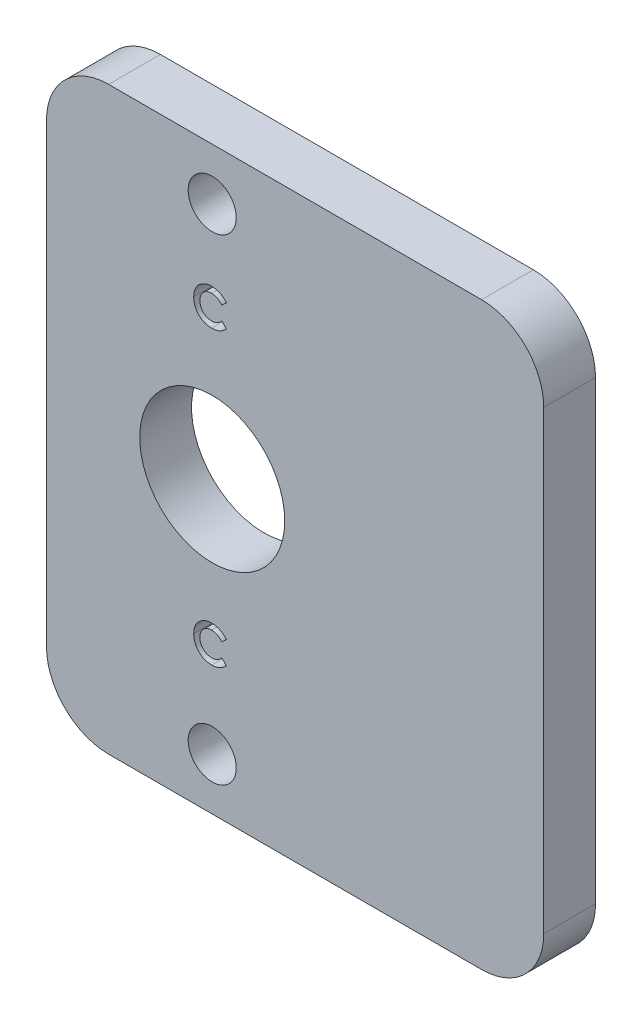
ISO-10303-21;
HEADER;
FILE_DESCRIPTION(('STEP AP214'),'2;1');
FILE_NAME('part.step','',(''),(''),'','','');
FILE_SCHEMA(('AUTOMOTIVE_DESIGN { 1 0 10303 214 1 1 1 1 }'));
ENDSEC;
DATA;
#1=APPLICATION_CONTEXT('core data for automotive mechanical design processes');
#2=APPLICATION_PROTOCOL_DEFINITION('international standard','automotive_design',2000,#1);
#3=PRODUCT_CONTEXT('',#1,'mechanical');
#4=PRODUCT('Part','Part','',(#3));
#5=PRODUCT_RELATED_PRODUCT_CATEGORY('part','',(#4));
#6=PRODUCT_DEFINITION_FORMATION('','',#4);
#7=PRODUCT_DEFINITION_CONTEXT('part definition',#1,'design');
#8=PRODUCT_DEFINITION('design','',#6,#7);
#9=PRODUCT_DEFINITION_SHAPE('','',#8);
#10=(LENGTH_UNIT() NAMED_UNIT(*) SI_UNIT(.MILLI.,.METRE.));
#11=(NAMED_UNIT(*) PLANE_ANGLE_UNIT() SI_UNIT($,.RADIAN.));
#12=(NAMED_UNIT(*) SI_UNIT($,.STERADIAN.) SOLID_ANGLE_UNIT());
#13=UNCERTAINTY_MEASURE_WITH_UNIT(LENGTH_MEASURE(1.E-05),#10,'distance_accuracy_value','');
#14=(GEOMETRIC_REPRESENTATION_CONTEXT(3) GLOBAL_UNCERTAINTY_ASSIGNED_CONTEXT((#13)) GLOBAL_UNIT_ASSIGNED_CONTEXT((#10,
#11,#12)) REPRESENTATION_CONTEXT('',''));
#15=CARTESIAN_POINT('',(0.,0.,0.));
#16=DIRECTION('',(0.,0.,1.));
#17=DIRECTION('',(1.,0.,0.));
#18=AXIS2_PLACEMENT_3D('',#15,#16,#17);
#19=CARTESIAN_POINT('',(0.,0.,3.175));
#20=DIRECTION('',(0.,0.,-1.));
#21=DIRECTION('',(-1.,0.,0.));
#22=AXIS2_PLACEMENT_3D('',#19,#20,#21);
#23=PLANE('',#22);
#24=CARTESIAN_POINT('',(10.1306583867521,28.0027577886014,3.175));
#25=CARTESIAN_POINT('',(10.1520110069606,28.0024379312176,3.175));
#26=CARTESIAN_POINT('',(10.1944942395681,28.0018015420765,3.175));
#27=CARTESIAN_POINT('',(10.2577589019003,27.9964965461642,3.175));
#28=CARTESIAN_POINT('',(10.3205176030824,27.9881651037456,3.175));
#29=CARTESIAN_POINT('',(10.3825456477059,27.9755947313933,3.175));
#30=CARTESIAN_POINT('',(10.444286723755,27.9606721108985,3.175));
#31=CARTESIAN_POINT('',(10.5049294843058,27.9411329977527,3.175));
#32=CARTESIAN_POINT('',(10.5654306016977,27.9193529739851,3.175));
#33=CARTESIAN_POINT('',(10.6248412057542,27.8933194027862,3.175));
#34=CARTESIAN_POINT('',(10.6832442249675,27.8649014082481,3.175));
#35=CARTESIAN_POINT('',(10.7392714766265,27.8326601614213,3.175));
#36=CARTESIAN_POINT('',(10.7938636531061,27.7985797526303,3.175));
#37=CARTESIAN_POINT('',(10.8458110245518,27.7606431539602,3.175));
#38=CARTESIAN_POINT('',(10.8960866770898,27.7202263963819,3.175));
#39=CARTESIAN_POINT('',(10.9444277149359,27.6771409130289,3.175));
#40=CARTESIAN_POINT('',(10.9904099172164,27.6306683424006,3.175));
#41=CARTESIAN_POINT('',(11.0192657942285,27.5978327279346,3.175));
#42=CARTESIAN_POINT('',(11.0338034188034,27.5812901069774,3.175));
#43=B_SPLINE_CURVE_WITH_KNOTS('',3,(#24,#25,#26,#27,#28,#29,#30,#31,#32,#33,#34,#35,#36,#37,#38,
#39,#40,#41,#42),.UNSPECIFIED.,.F.,.F.,(4,1,1,1,1,1,1,1,1,1,1,1,1,1,1,1,4),(0.,
0.0622757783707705,0.123904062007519,0.185067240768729,0.246840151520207,0.308435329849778,
0.370241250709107,0.432586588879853,0.495924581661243,0.559351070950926,0.62194265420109,
0.684392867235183,0.746985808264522,0.809441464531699,0.872507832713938,0.935769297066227,1.),.UNSPECIFIED.);
#44=CARTESIAN_POINT('',(10.1306583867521,28.0027577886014,3.175));
#45=VERTEX_POINT('',#44);
#46=CARTESIAN_POINT('',(11.0338034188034,27.5812901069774,3.175));
#47=VERTEX_POINT('',#46);
#48=EDGE_CURVE('E234',#45,#47,#43,.T.);
#49=ORIENTED_EDGE('',*,*,#48,.T.);
#50=DIRECTION('',(-0.722880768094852,-0.690972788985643,0.));
#51=VECTOR('',#50,1.);
#52=CARTESIAN_POINT('',(11.0338034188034,27.5812901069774,3.175));
#53=LINE('',#52,#51);
#54=CARTESIAN_POINT('',(10.7552276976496,27.3150107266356,3.175));
#55=VERTEX_POINT('',#54);
#56=EDGE_CURVE('E296',#47,#55,#53,.T.);
#57=ORIENTED_EDGE('',*,*,#56,.T.);
#58=CARTESIAN_POINT('',(10.7552276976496,27.3150107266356,3.175));
#59=CARTESIAN_POINT('',(10.7315966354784,27.339445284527,3.175));
#60=CARTESIAN_POINT('',(10.6854377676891,27.3871736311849,3.175));
#61=CARTESIAN_POINT('',(10.6110584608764,27.4503617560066,3.175));
#62=CARTESIAN_POINT('',(10.5337066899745,27.5030205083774,3.175));
#63=CARTESIAN_POINT('',(10.4548871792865,27.5473693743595,3.175));
#64=CARTESIAN_POINT('',(10.3731821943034,27.5809224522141,3.175));
#65=CARTESIAN_POINT('',(10.2895364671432,27.6053731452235,3.175));
#66=CARTESIAN_POINT('',(10.2034158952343,27.6202798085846,3.175));
#67=CARTESIAN_POINT('',(10.1451328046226,27.6219853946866,3.175));
#68=CARTESIAN_POINT('',(10.1158179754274,27.6228432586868,3.175));
#69=B_SPLINE_CURVE_WITH_KNOTS('',3,(#58,#59,#60,#61,#62,#63,#64,#65,#66,#67,#68),.UNSPECIFIED.,
.F.,.F.,(4,1,1,1,1,1,1,1,4),(0.,0.139406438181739,0.272304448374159,0.399525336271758,
0.522810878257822,0.642662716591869,0.761022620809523,0.879800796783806,1.),.UNSPECIFIED.);
#70=CARTESIAN_POINT('',(10.1158179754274,27.6228432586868,3.175));
#71=VERTEX_POINT('',#70);
#72=EDGE_CURVE('E302',#55,#71,#69,.T.);
#73=ORIENTED_EDGE('',*,*,#72,.T.);
#74=CARTESIAN_POINT('',(10.1158179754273,27.6228432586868,3.175));
#75=CARTESIAN_POINT('',(10.0913365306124,27.6221655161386,3.175));
#76=CARTESIAN_POINT('',(10.0430250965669,27.6208280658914,3.175));
#77=CARTESIAN_POINT('',(9.97209125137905,27.6110232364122,3.175));
#78=CARTESIAN_POINT('',(9.9042393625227,27.5943496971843,3.175));
#79=CARTESIAN_POINT('',(9.83923716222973,27.5713704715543,3.175));
#80=CARTESIAN_POINT('',(9.77727592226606,27.5416365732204,3.175));
#81=CARTESIAN_POINT('',(9.71822573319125,27.5051710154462,3.175));
#82=CARTESIAN_POINT('',(9.66223218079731,27.4623031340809,3.175));
#83=CARTESIAN_POINT('',(9.61003490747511,27.4132547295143,3.175));
#84=CARTESIAN_POINT('',(9.5622866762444,27.359665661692,3.175));
#85=CARTESIAN_POINT('',(9.52009807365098,27.3024862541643,3.175));
#86=CARTESIAN_POINT('',(9.48475835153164,27.2418475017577,3.175));
#87=CARTESIAN_POINT('',(9.45575561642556,27.1783635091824,3.175));
#88=CARTESIAN_POINT('',(9.4331636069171,27.1117404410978,3.175));
#89=CARTESIAN_POINT('',(9.4170300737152,27.0420231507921,3.175));
#90=CARTESIAN_POINT('',(9.40769886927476,26.9691286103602,3.175));
#91=CARTESIAN_POINT('',(9.40630612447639,26.9195754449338,3.175));
#92=CARTESIAN_POINT('',(9.40559829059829,26.8943910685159,3.175));
#93=B_SPLINE_CURVE_WITH_KNOTS('',3,(#74,#75,#76,#77,#78,#79,#80,#81,#82,#83,#84,#85,#86,#87,#88,
#89,#90,#91,#92),.UNSPECIFIED.,.F.,.F.,(4,1,1,1,1,1,1,1,1,1,1,1,1,1,1,1,4),(0.,
0.0647145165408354,0.127706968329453,0.188882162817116,0.24915829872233,0.309661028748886,
0.370224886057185,0.432332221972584,0.495781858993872,0.559304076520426,0.621860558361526,
0.683321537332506,0.744522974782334,0.80608837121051,0.868994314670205,0.933419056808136,1.),.UNSPECIFIED.);
#94=CARTESIAN_POINT('',(9.40559829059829,26.8943910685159,3.175));
#95=VERTEX_POINT('',#94);
#96=EDGE_CURVE('E307',#71,#95,#93,.T.);
#97=ORIENTED_EDGE('',*,*,#96,.T.);
#98=CARTESIAN_POINT('',(9.40559829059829,26.8943910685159,3.175));
#99=CARTESIAN_POINT('',(9.40580228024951,26.8767149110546,3.175));
#100=CARTESIAN_POINT('',(9.40620434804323,26.8418748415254,3.175));
#101=CARTESIAN_POINT('',(9.410605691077,26.7903367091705,3.175));
#102=CARTESIAN_POINT('',(9.41769289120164,26.7403325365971,3.175));
#103=CARTESIAN_POINT('',(9.42794982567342,26.6919380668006,3.175));
#104=CARTESIAN_POINT('',(9.44077622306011,26.6451113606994,3.175));
#105=CARTESIAN_POINT('',(9.45582450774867,26.5994484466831,3.175));
#106=CARTESIAN_POINT('',(9.47470235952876,26.555580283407,3.175));
#107=CARTESIAN_POINT('',(9.49565705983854,26.5129973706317,3.175));
#108=CARTESIAN_POINT('',(9.52002713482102,26.472861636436,3.175));
#109=CARTESIAN_POINT('',(9.54630257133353,26.4345888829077,3.175));
#110=CARTESIAN_POINT('',(9.57479399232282,26.3983667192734,3.175));
#111=CARTESIAN_POINT('',(9.60568593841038,26.3643432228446,3.175));
#112=CARTESIAN_POINT('',(9.63941317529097,26.3330501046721,3.175));
#113=CARTESIAN_POINT('',(9.67510397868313,26.3035463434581,3.175));
#114=CARTESIAN_POINT('',(9.71336040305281,26.2765705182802,3.175));
#115=CARTESIAN_POINT('',(9.75338776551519,26.2514456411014,3.175));
#116=CARTESIAN_POINT('',(9.79553185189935,26.2296194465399,3.175));
#117=CARTESIAN_POINT('',(9.83864919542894,26.2098491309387,3.175));
#118=CARTESIAN_POINT('',(9.88339354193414,26.1937926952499,3.175));
#119=CARTESIAN_POINT('',(9.92922010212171,26.1808497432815,3.175));
#120=CARTESIAN_POINT('',(9.97596510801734,26.1698436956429,3.175));
#121=CARTESIAN_POINT('',(10.0240857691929,26.1630669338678,3.175));
#122=CARTESIAN_POINT('',(10.0731649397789,26.1579349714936,3.175));
#123=CARTESIAN_POINT('',(10.1063342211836,26.1576181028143,3.175));
#124=CARTESIAN_POINT('',(10.1230261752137,26.1574586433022,3.175));
#125=B_SPLINE_CURVE_WITH_KNOTS('',3,(#98,#99,#100,#101,#102,#103,#104,#105,#106,#107,#108,#109,
#110,#111,#112,#113,#114,#115,#116,#117,#118,#119,#120,#121,#122,#123,#124),.UNSPECIFIED.,.F.,
.F.,(4,1,1,1,1,1,1,1,1,1,1,1,1,1,1,1,1,1,1,1,1,1,1,1,4),(0.,0.0459858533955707,
0.0906390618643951,0.134485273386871,0.177331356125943,0.219264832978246,0.260785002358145,
0.30231657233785,0.343435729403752,0.384181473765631,0.424375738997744,0.464181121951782,
0.50401198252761,0.543822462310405,0.583802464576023,0.624418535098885,0.665547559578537,
0.706674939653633,0.747826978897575,0.788895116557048,0.830219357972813,0.871706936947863,
0.913733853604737,0.956587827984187,1.),.UNSPECIFIED.);
#126=CARTESIAN_POINT('',(10.1230261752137,26.1574586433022,3.175));
#127=VERTEX_POINT('',#126);
#128=EDGE_CURVE('E315',#95,#127,#125,.T.);
#129=ORIENTED_EDGE('',*,*,#128,.T.);
#130=CARTESIAN_POINT('',(10.1230261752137,26.1574586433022,3.175));
#131=CARTESIAN_POINT('',(10.1513385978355,26.1582775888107,3.175));
#132=CARTESIAN_POINT('',(10.2069651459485,26.1598866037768,3.175));
#133=CARTESIAN_POINT('',(10.288605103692,26.1724688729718,3.175));
#134=CARTESIAN_POINT('',(10.3663998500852,26.1931659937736,3.175));
#135=CARTESIAN_POINT('',(10.4285574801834,26.217608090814,3.175));
#136=CARTESIAN_POINT('',(10.4772563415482,26.2417449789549,3.175));
#137=CARTESIAN_POINT('',(10.5143300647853,26.2640704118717,3.175));
#138=CARTESIAN_POINT('',(10.552667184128,26.2890438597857,3.175));
#139=CARTESIAN_POINT('',(10.5916309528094,26.3176078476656,3.175));
#140=CARTESIAN_POINT('',(10.6316596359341,26.349419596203,3.175));
#141=CARTESIAN_POINT('',(10.6720466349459,26.3851758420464,3.175));
#142=CARTESIAN_POINT('',(10.7138258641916,26.4236991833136,3.175));
#143=CARTESIAN_POINT('',(10.7411950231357,26.4511940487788,3.175));
#144=CARTESIAN_POINT('',(10.7552276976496,26.4652911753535,3.175));
#145=B_SPLINE_CURVE_WITH_KNOTS('',3,(#130,#131,#132,#133,#134,#135,#136,#137,#138,#139,#140,
#141,#142,#143,#144),.UNSPECIFIED.,.F.,.F.,(4,1,1,1,1,1,1,1,1,1,1,1,4),(0.,0.117048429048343,
0.229969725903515,0.340703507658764,0.449355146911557,0.505556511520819,0.565302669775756,
0.628204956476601,0.694728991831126,0.765018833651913,0.83958020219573,0.917749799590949,1.),.UNSPECIFIED.);
#146=CARTESIAN_POINT('',(10.7552276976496,26.4652911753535,3.175));
#147=VERTEX_POINT('',#146);
#148=EDGE_CURVE('E323',#127,#147,#145,.T.);
#149=ORIENTED_EDGE('',*,*,#148,.T.);
#150=DIRECTION('',(0.689574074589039,-0.72421515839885,0.));
#151=VECTOR('',#150,1.);
#152=CARTESIAN_POINT('',(10.7552276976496,26.4652911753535,3.175));
#153=LINE('',#152,#151);
#154=CARTESIAN_POINT('',(11.0253231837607,26.181627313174,3.175));
#155=VERTEX_POINT('',#154);
#156=EDGE_CURVE('E331',#147,#155,#153,.T.);
#157=ORIENTED_EDGE('',*,*,#156,.T.);
#158=CARTESIAN_POINT('',(11.0253231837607,26.181627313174,3.175));
#159=CARTESIAN_POINT('',(11.0063369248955,26.1632966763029,3.175));
#160=CARTESIAN_POINT('',(10.9692798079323,26.127519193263,3.175));
#161=CARTESIAN_POINT('',(10.9133801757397,26.076718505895,3.175));
#162=CARTESIAN_POINT('',(10.8575508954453,26.0310684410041,3.175));
#163=CARTESIAN_POINT('',(10.803140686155,25.9889121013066,3.175));
#164=CARTESIAN_POINT('',(10.7492582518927,25.9514776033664,3.175));
#165=CARTESIAN_POINT('',(10.6959093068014,25.9187275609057,3.175));
#166=CARTESIAN_POINT('',(10.6436977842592,25.8898336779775,3.175));
#167=CARTESIAN_POINT('',(10.5915394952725,25.8652832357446,3.175));
#168=CARTESIAN_POINT('',(10.5391098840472,25.8444373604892,3.175));
#169=CARTESIAN_POINT('',(10.4851659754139,25.8264904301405,3.175));
#170=CARTESIAN_POINT('',(10.429542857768,25.8113079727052,3.175));
#171=CARTESIAN_POINT('',(10.3719008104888,25.7990577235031,3.175));
#172=CARTESIAN_POINT('',(10.3127774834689,25.7892346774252,3.175));
#173=CARTESIAN_POINT('',(10.2516195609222,25.7826041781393,3.175));
#174=CARTESIAN_POINT('',(10.1888148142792,25.7781467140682,3.175));
#175=CARTESIAN_POINT('',(10.1462133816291,25.7777461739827,3.175));
#176=CARTESIAN_POINT('',(10.1247222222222,25.7775441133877,3.175));
#177=B_SPLINE_CURVE_WITH_KNOTS('',3,(#158,#159,#160,#161,#162,#163,#164,#165,#166,#167,#168,
#169,#170,#171,#172,#173,#174,#175,#176),.UNSPECIFIED.,.F.,.F.,(4,1,1,1,1,1,1,1,1,1,1,1,1,1,1,1,
4),(0.,0.0777829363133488,0.151815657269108,0.222539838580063,0.290277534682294,
0.354640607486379,0.415797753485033,0.474709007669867,0.530426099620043,0.585579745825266,
0.640906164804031,0.697901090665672,0.755420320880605,0.81452125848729,0.874461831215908,
0.936669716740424,1.),.UNSPECIFIED.);
#178=CARTESIAN_POINT('',(10.1247222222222,25.7775441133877,3.175));
#179=VERTEX_POINT('',#178);
#180=EDGE_CURVE('E337',#155,#179,#177,.T.);
#181=ORIENTED_EDGE('',*,*,#180,.T.);
#182=CARTESIAN_POINT('',(10.1247222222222,25.7775441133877,3.175));
#183=CARTESIAN_POINT('',(10.0852456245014,25.7785504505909,3.175));
#184=CARTESIAN_POINT('',(10.008000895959,25.780519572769,3.175));
#185=CARTESIAN_POINT('',(9.89480076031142,25.7951094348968,3.175));
#186=CARTESIAN_POINT('',(9.78726367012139,25.8195690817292,3.175));
#187=CARTESIAN_POINT('',(9.68512800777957,25.8541617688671,3.175));
#188=CARTESIAN_POINT('',(9.58842625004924,25.8983523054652,3.175));
#189=CARTESIAN_POINT('',(9.49718313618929,25.9525278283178,3.175));
#190=CARTESIAN_POINT('',(9.41154572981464,26.0165444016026,3.175));
#191=CARTESIAN_POINT('',(9.33220581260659,26.0896516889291,3.175));
#192=CARTESIAN_POINT('',(9.26043908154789,26.1703925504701,3.175));
#193=CARTESIAN_POINT('',(9.19700560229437,26.2570860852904,3.175));
#194=CARTESIAN_POINT('',(9.14453342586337,26.3501583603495,3.175));
#195=CARTESIAN_POINT('',(9.10096464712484,26.4482344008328,3.175));
#196=CARTESIAN_POINT('',(9.0668944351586,26.5517617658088,3.175));
#197=CARTESIAN_POINT('',(9.04291478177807,26.6608524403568,3.175));
#198=CARTESIAN_POINT('',(9.02812670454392,26.7754010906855,3.175));
#199=CARTESIAN_POINT('',(9.02650886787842,26.8536404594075,3.175));
#200=CARTESIAN_POINT('',(9.02568376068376,26.8935430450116,3.175));
#201=B_SPLINE_CURVE_WITH_KNOTS('',3,(#182,#183,#184,#185,#186,#187,#188,#189,#190,#191,#192,
#193,#194,#195,#196,#197,#198,#199,#200),.UNSPECIFIED.,.F.,.F.,(4,1,1,1,1,1,1,1,1,1,1,1,1,1,1,1,
4),(0.,0.0673762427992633,0.13183657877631,0.194461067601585,0.255345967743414,
0.315588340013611,0.375627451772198,0.436137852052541,0.497778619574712,0.559470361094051,
0.620277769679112,0.680787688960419,0.741491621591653,0.803215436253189,0.86649276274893,
0.931910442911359,1.),.UNSPECIFIED.);
#202=CARTESIAN_POINT('',(9.02568376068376,26.8935430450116,3.175));
#203=VERTEX_POINT('',#202);
#204=EDGE_CURVE('E342',#179,#203,#201,.T.);
#205=ORIENTED_EDGE('',*,*,#204,.T.);
#206=CARTESIAN_POINT('',(9.02568376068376,26.8935430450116,3.175));
#207=CARTESIAN_POINT('',(9.02603241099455,26.9195671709,3.175));
#208=CARTESIAN_POINT('',(9.02672335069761,26.9711406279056,3.175));
#209=CARTESIAN_POINT('',(9.03398519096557,27.0471125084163,3.175));
#210=CARTESIAN_POINT('',(9.0441086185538,27.1211715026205,3.175));
#211=CARTESIAN_POINT('',(9.06016851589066,27.1925486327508,3.175));
#212=CARTESIAN_POINT('',(9.07952713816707,27.2622054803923,3.175));
#213=CARTESIAN_POINT('',(9.10360212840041,27.3293849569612,3.175));
#214=CARTESIAN_POINT('',(9.13235503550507,27.3942801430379,3.175));
#215=CARTESIAN_POINT('',(9.16485908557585,27.4569996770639,3.175));
#216=CARTESIAN_POINT('',(9.20163059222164,27.5171326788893,3.175));
#217=CARTESIAN_POINT('',(9.24270840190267,27.5741625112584,3.175));
#218=CARTESIAN_POINT('',(9.28703501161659,27.6285294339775,3.175));
#219=CARTESIAN_POINT('',(9.3356755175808,27.6795121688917,3.175));
#220=CARTESIAN_POINT('',(9.3879231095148,27.727558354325,3.175));
#221=CARTESIAN_POINT('',(9.44401367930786,27.7724076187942,3.175));
#222=CARTESIAN_POINT('',(9.50360987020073,27.8147031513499,3.175));
#223=CARTESIAN_POINT('',(9.56687298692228,27.8533542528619,3.175));
#224=CARTESIAN_POINT('',(9.63257399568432,27.8883162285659,3.175));
#225=CARTESIAN_POINT('',(9.69988423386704,27.9191541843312,3.175));
#226=CARTESIAN_POINT('',(9.7686383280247,27.9449276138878,3.175));
#227=CARTESIAN_POINT('',(9.83854557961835,27.9663057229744,3.175));
#228=CARTESIAN_POINT('',(9.90990134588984,27.9822629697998,3.175));
#229=CARTESIAN_POINT('',(9.98219630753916,27.99434209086,3.175));
#230=CARTESIAN_POINT('',(10.0560456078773,28.001094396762,3.175));
#231=CARTESIAN_POINT('',(10.1056290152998,28.0021997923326,3.175));
#232=CARTESIAN_POINT('',(10.1306583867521,28.0027577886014,3.175));
#233=B_SPLINE_CURVE_WITH_KNOTS('',3,(#206,#207,#208,#209,#210,#211,#212,#213,#214,#215,#216,
#217,#218,#219,#220,#221,#222,#223,#224,#225,#226,#227,#228,#229,#230,#231,#232),.UNSPECIFIED.,
.F.,.F.,(4,1,1,1,1,1,1,1,1,1,1,1,1,1,1,1,1,1,1,1,1,1,1,1,4),(0.,0.0446633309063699,
0.0885118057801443,0.130925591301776,0.172904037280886,0.214000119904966,0.254985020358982,
0.295291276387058,0.335772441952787,0.37618082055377,0.41617840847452,0.456350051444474,
0.496512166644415,0.53704057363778,0.578118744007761,0.619724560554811,0.662421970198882,
0.705298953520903,0.747430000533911,0.789432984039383,0.831267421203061,0.872825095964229,
0.914870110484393,0.957027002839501,1.),.UNSPECIFIED.);
#234=EDGE_CURVE('E350',#203,#45,#233,.T.);
#235=ORIENTED_EDGE('',*,*,#234,.T.);
#236=EDGE_LOOP('',(#49,#57,#73,#97,#129,#149,#157,#181,#205,#235));
#237=FACE_BOUND('',#236,.T.);
#238=CARTESIAN_POINT('',(10.16,3.175,3.175));
#239=DIRECTION('',(0.,0.,1.));
#240=DIRECTION('',(1.,0.,0.));
#241=AXIS2_PLACEMENT_3D('',#238,#239,#240);
#242=CIRCLE('',#241,1.47319999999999);
#243=CARTESIAN_POINT('',(11.6332,3.175,3.175));
#244=VERTEX_POINT('',#243);
#245=EDGE_CURVE('E383',#244,#244,#242,.T.);
#246=ORIENTED_EDGE('',*,*,#245,.F.);
#247=EDGE_LOOP('',(#246));
#248=FACE_BOUND('',#247,.T.);
#249=CARTESIAN_POINT('',(10.16,32.385,3.175));
#250=DIRECTION('',(0.,0.,1.));
#251=DIRECTION('',(1.,0.,0.));
#252=AXIS2_PLACEMENT_3D('',#249,#250,#251);
#253=CIRCLE('',#252,1.47319999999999);
#254=CARTESIAN_POINT('',(11.6332,32.385,3.175));
#255=VERTEX_POINT('',#254);
#256=EDGE_CURVE('E387',#255,#255,#253,.T.);
#257=ORIENTED_EDGE('',*,*,#256,.F.);
#258=EDGE_LOOP('',(#257));
#259=FACE_BOUND('',#258,.T.);
#260=DIRECTION('',(0.,-1.,0.));
#261=VECTOR('',#260,1.);
#262=CARTESIAN_POINT('',(0.,0.,3.175));
#263=LINE('',#262,#261);
#264=CARTESIAN_POINT('',(0.,31.75,3.175));
#265=VERTEX_POINT('',#264);
#266=CARTESIAN_POINT('',(0.,3.81,3.175));
#267=VERTEX_POINT('',#266);
#268=EDGE_CURVE('E398',#265,#267,#263,.T.);
#269=ORIENTED_EDGE('',*,*,#268,.T.);
#270=CARTESIAN_POINT('',(3.81,3.81,3.175));
#271=DIRECTION('',(0.,0.,-1.));
#272=DIRECTION('',(-1.,0.,0.));
#273=AXIS2_PLACEMENT_3D('',#270,#271,#272);
#274=CIRCLE('',#273,3.81);
#275=CARTESIAN_POINT('',(3.81,0.,3.175));
#276=VERTEX_POINT('',#275);
#277=EDGE_CURVE('E449',#267,#276,#274,.F.);
#278=ORIENTED_EDGE('',*,*,#277,.T.);
#279=DIRECTION('',(1.,0.,0.));
#280=VECTOR('',#279,1.);
#281=CARTESIAN_POINT('',(0.,0.,3.175));
#282=LINE('',#281,#280);
#283=CARTESIAN_POINT('',(26.67,0.,3.175));
#284=VERTEX_POINT('',#283);
#285=EDGE_CURVE('E401',#276,#284,#282,.T.);
#286=ORIENTED_EDGE('',*,*,#285,.T.);
#287=CARTESIAN_POINT('',(26.67,3.81,3.175));
#288=DIRECTION('',(0.,0.,-1.));
#289=DIRECTION('',(-1.,0.,0.));
#290=AXIS2_PLACEMENT_3D('',#287,#288,#289);
#291=CIRCLE('',#290,3.81);
#292=CARTESIAN_POINT('',(30.48,3.81,3.175));
#293=VERTEX_POINT('',#292);
#294=EDGE_CURVE('E447',#284,#293,#291,.F.);
#295=ORIENTED_EDGE('',*,*,#294,.T.);
#296=DIRECTION('',(0.,1.,0.));
#297=VECTOR('',#296,1.);
#298=CARTESIAN_POINT('',(30.48,0.,3.175));
#299=LINE('',#298,#297);
#300=CARTESIAN_POINT('',(30.48,31.75,3.175));
#301=VERTEX_POINT('',#300);
#302=EDGE_CURVE('E405',#293,#301,#299,.T.);
#303=ORIENTED_EDGE('',*,*,#302,.T.);
#304=CARTESIAN_POINT('',(26.67,31.75,3.175));
#305=DIRECTION('',(0.,0.,-1.));
#306=DIRECTION('',(-1.,0.,0.));
#307=AXIS2_PLACEMENT_3D('',#304,#305,#306);
#308=CIRCLE('',#307,3.81);
#309=CARTESIAN_POINT('',(26.67,35.56,3.175));
#310=VERTEX_POINT('',#309);
#311=EDGE_CURVE('E445',#301,#310,#308,.F.);
#312=ORIENTED_EDGE('',*,*,#311,.T.);
#313=DIRECTION('',(-1.,0.,0.));
#314=VECTOR('',#313,1.);
#315=CARTESIAN_POINT('',(0.,35.56,3.175));
#316=LINE('',#315,#314);
#317=CARTESIAN_POINT('',(3.81,35.56,3.175));
#318=VERTEX_POINT('',#317);
#319=EDGE_CURVE('E408',#310,#318,#316,.T.);
#320=ORIENTED_EDGE('',*,*,#319,.T.);
#321=CARTESIAN_POINT('',(3.81,31.75,3.175));
#322=DIRECTION('',(0.,0.,-1.));
#323=DIRECTION('',(-1.,0.,0.));
#324=AXIS2_PLACEMENT_3D('',#321,#322,#323);
#325=CIRCLE('',#324,3.81);
#326=EDGE_CURVE('E443',#318,#265,#325,.F.);
#327=ORIENTED_EDGE('',*,*,#326,.T.);
#328=EDGE_LOOP('',(#269,#278,#286,#295,#303,#312,#320,#327));
#329=FACE_BOUND('',#328,.T.);
#330=CARTESIAN_POINT('',(10.16,17.78,3.175));
#331=DIRECTION('',(0.,0.,1.));
#332=DIRECTION('',(1.,0.,0.));
#333=AXIS2_PLACEMENT_3D('',#330,#331,#332);
#334=CIRCLE('',#333,4.445);
#335=CARTESIAN_POINT('',(14.605,17.78,3.175));
#336=VERTEX_POINT('',#335);
#337=EDGE_CURVE('E391',#336,#336,#334,.T.);
#338=ORIENTED_EDGE('',*,*,#337,.F.);
#339=EDGE_LOOP('',(#338));
#340=FACE_BOUND('',#339,.T.);
#341=CARTESIAN_POINT('',(10.1306583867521,10.1216588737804,3.175));
#342=CARTESIAN_POINT('',(10.1520110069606,10.1213390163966,3.175));
#343=CARTESIAN_POINT('',(10.1944942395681,10.1207026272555,3.175));
#344=CARTESIAN_POINT('',(10.2577589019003,10.1153976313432,3.175));
#345=CARTESIAN_POINT('',(10.3205176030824,10.1070661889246,3.175));
#346=CARTESIAN_POINT('',(10.3825456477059,10.0944958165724,3.175));
#347=CARTESIAN_POINT('',(10.444286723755,10.0795731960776,3.175));
#348=CARTESIAN_POINT('',(10.5049294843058,10.0600340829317,3.175));
#349=CARTESIAN_POINT('',(10.5654306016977,10.0382540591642,3.175));
#350=CARTESIAN_POINT('',(10.6248412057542,10.0122204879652,3.175));
#351=CARTESIAN_POINT('',(10.6832442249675,9.98380249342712,3.175));
#352=CARTESIAN_POINT('',(10.7392714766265,9.95156124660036,3.175));
#353=CARTESIAN_POINT('',(10.7938636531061,9.91748083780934,3.175));
#354=CARTESIAN_POINT('',(10.8458110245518,9.87954423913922,3.175));
#355=CARTESIAN_POINT('',(10.8960866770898,9.83912748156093,3.175));
#356=CARTESIAN_POINT('',(10.9444277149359,9.79604199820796,3.175));
#357=CARTESIAN_POINT('',(10.9904099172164,9.74956942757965,3.175));
#358=CARTESIAN_POINT('',(11.0192657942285,9.71673381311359,3.175));
#359=CARTESIAN_POINT('',(11.0338034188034,9.70019119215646,3.175));
#360=B_SPLINE_CURVE_WITH_KNOTS('',3,(#341,#342,#343,#344,#345,#346,#347,#348,#349,#350,#351,
#352,#353,#354,#355,#356,#357,#358,#359),.UNSPECIFIED.,.F.,.F.,(4,1,1,1,1,1,1,1,1,1,1,1,1,1,1,1,
4),(0.,0.0622757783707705,0.123904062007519,0.185067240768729,0.246840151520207,
0.308435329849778,0.370241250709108,0.432586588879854,0.495924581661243,0.559351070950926,
0.621942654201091,0.684392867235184,0.746985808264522,0.809441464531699,0.872507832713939,
0.935769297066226,1.),.UNSPECIFIED.);
#361=CARTESIAN_POINT('',(10.1306583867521,10.1216588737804,3.175));
#362=VERTEX_POINT('',#361);
#363=CARTESIAN_POINT('',(11.0338034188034,9.70019119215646,3.175));
#364=VERTEX_POINT('',#363);
#365=EDGE_CURVE('E48',#362,#364,#360,.T.);
#366=ORIENTED_EDGE('',*,*,#365,.T.);
#367=DIRECTION('',(-0.722880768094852,-0.690972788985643,0.));
#368=VECTOR('',#367,1.);
#369=CARTESIAN_POINT('',(11.0338034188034,9.70019119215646,3.175));
#370=LINE('',#369,#368);
#371=CARTESIAN_POINT('',(10.7552276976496,9.43391181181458,3.175));
#372=VERTEX_POINT('',#371);
#373=EDGE_CURVE('E233',#364,#372,#370,.T.);
#374=ORIENTED_EDGE('',*,*,#373,.T.);
#375=CARTESIAN_POINT('',(10.7552276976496,9.43391181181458,3.175));
#376=CARTESIAN_POINT('',(10.7315966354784,9.45834636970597,3.175));
#377=CARTESIAN_POINT('',(10.6854377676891,9.50607471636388,3.175));
#378=CARTESIAN_POINT('',(10.6110584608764,9.56926284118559,3.175));
#379=CARTESIAN_POINT('',(10.5337066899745,9.62192159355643,3.175));
#380=CARTESIAN_POINT('',(10.4548871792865,9.66627045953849,3.175));
#381=CARTESIAN_POINT('',(10.3731821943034,9.69982353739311,3.175));
#382=CARTESIAN_POINT('',(10.2895364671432,9.72427423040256,3.175));
#383=CARTESIAN_POINT('',(10.2034158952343,9.73918089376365,3.175));
#384=CARTESIAN_POINT('',(10.1451328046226,9.74088647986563,3.175));
#385=CARTESIAN_POINT('',(10.1158179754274,9.74174434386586,3.175));
#386=B_SPLINE_CURVE_WITH_KNOTS('',3,(#375,#376,#377,#378,#379,#380,#381,#382,#383,#384,#385),
.UNSPECIFIED.,.F.,.F.,(4,1,1,1,1,1,1,1,4),(0.,0.139406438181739,0.272304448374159,
0.39952533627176,0.522810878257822,0.642662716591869,0.761022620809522,0.879800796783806,1.),.UNSPECIFIED.);
#387=CARTESIAN_POINT('',(10.1158179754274,9.74174434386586,3.175));
#388=VERTEX_POINT('',#387);
#389=EDGE_CURVE('E798',#372,#388,#386,.T.);
#390=ORIENTED_EDGE('',*,*,#389,.T.);
#391=CARTESIAN_POINT('',(10.1158179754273,9.74174434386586,3.175));
#392=CARTESIAN_POINT('',(10.0913365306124,9.74106660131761,3.175));
#393=CARTESIAN_POINT('',(10.0430250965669,9.7397291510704,3.175));
#394=CARTESIAN_POINT('',(9.97209125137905,9.72992432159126,3.175));
#395=CARTESIAN_POINT('',(9.9042393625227,9.71325078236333,3.175));
#396=CARTESIAN_POINT('',(9.83923716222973,9.69027155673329,3.175));
#397=CARTESIAN_POINT('',(9.77727592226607,9.66053765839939,3.175));
#398=CARTESIAN_POINT('',(9.71822573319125,9.62407210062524,3.175));
#399=CARTESIAN_POINT('',(9.66223218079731,9.58120421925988,3.175));
#400=CARTESIAN_POINT('',(9.61003490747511,9.53215581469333,3.175));
#401=CARTESIAN_POINT('',(9.5622866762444,9.47856674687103,3.175));
#402=CARTESIAN_POINT('',(9.52009807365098,9.42138733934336,3.175));
#403=CARTESIAN_POINT('',(9.48475835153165,9.36074858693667,3.175));
#404=CARTESIAN_POINT('',(9.45575561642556,9.29726459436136,3.175));
#405=CARTESIAN_POINT('',(9.4331636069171,9.23064152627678,3.175));
#406=CARTESIAN_POINT('',(9.4170300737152,9.16092423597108,3.175));
#407=CARTESIAN_POINT('',(9.40769886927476,9.08802969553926,3.175));
#408=CARTESIAN_POINT('',(9.4063061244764,9.03847653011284,3.175));
#409=CARTESIAN_POINT('',(9.40559829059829,9.01329215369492,3.175));
#410=B_SPLINE_CURVE_WITH_KNOTS('',3,(#391,#392,#393,#394,#395,#396,#397,#398,#399,#400,#401,
#402,#403,#404,#405,#406,#407,#408,#409),.UNSPECIFIED.,.F.,.F.,(4,1,1,1,1,1,1,1,1,1,1,1,1,1,1,1,
4),(0.,0.0647145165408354,0.127706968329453,0.188882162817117,0.24915829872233,
0.309661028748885,0.370224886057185,0.432332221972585,0.495781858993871,0.559304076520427,
0.621860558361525,0.683321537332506,0.744522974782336,0.806088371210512,0.868994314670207,
0.933419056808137,1.),.UNSPECIFIED.);
#411=CARTESIAN_POINT('',(9.40559829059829,9.01329215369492,3.175));
#412=VERTEX_POINT('',#411);
#413=EDGE_CURVE('E803',#388,#412,#410,.T.);
#414=ORIENTED_EDGE('',*,*,#413,.T.);
#415=CARTESIAN_POINT('',(9.40559829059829,9.01329215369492,3.175));
#416=CARTESIAN_POINT('',(9.40580228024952,8.99561599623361,3.175));
#417=CARTESIAN_POINT('',(9.40620434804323,8.96077592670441,3.175));
#418=CARTESIAN_POINT('',(9.410605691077,8.90923779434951,3.175));
#419=CARTESIAN_POINT('',(9.41769289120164,8.85923362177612,3.175));
#420=CARTESIAN_POINT('',(9.42794982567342,8.81083915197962,3.175));
#421=CARTESIAN_POINT('',(9.44077622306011,8.76401244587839,3.175));
#422=CARTESIAN_POINT('',(9.45582450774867,8.71834953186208,3.175));
#423=CARTESIAN_POINT('',(9.47470235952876,8.67448136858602,3.175));
#424=CARTESIAN_POINT('',(9.49565705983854,8.63189845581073,3.175));
#425=CARTESIAN_POINT('',(9.52002713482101,8.59176272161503,3.175));
#426=CARTESIAN_POINT('',(9.54630257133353,8.55348996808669,3.175));
#427=CARTESIAN_POINT('',(9.57479399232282,8.51726780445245,3.175));
#428=CARTESIAN_POINT('',(9.60568593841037,8.48324430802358,3.175));
#429=CARTESIAN_POINT('',(9.63941317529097,8.45195118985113,3.175));
#430=CARTESIAN_POINT('',(9.67510397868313,8.42244742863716,3.175));
#431=CARTESIAN_POINT('',(9.71336040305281,8.39547160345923,3.175));
#432=CARTESIAN_POINT('',(9.75338776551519,8.37034672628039,3.175));
#433=CARTESIAN_POINT('',(9.79553185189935,8.34852053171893,3.175));
#434=CARTESIAN_POINT('',(9.83864919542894,8.32875021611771,3.175));
#435=CARTESIAN_POINT('',(9.88339354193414,8.31269378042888,3.175));
#436=CARTESIAN_POINT('',(9.92922010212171,8.29975082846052,3.175));
#437=CARTESIAN_POINT('',(9.97596510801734,8.2887447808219,3.175));
#438=CARTESIAN_POINT('',(10.0240857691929,8.28196801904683,3.175));
#439=CARTESIAN_POINT('',(10.0731649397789,8.27683605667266,3.175));
#440=CARTESIAN_POINT('',(10.1063342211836,8.27651918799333,3.175));
#441=CARTESIAN_POINT('',(10.1230261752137,8.27635972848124,3.175));
#442=B_SPLINE_CURVE_WITH_KNOTS('',3,(#415,#416,#417,#418,#419,#420,#421,#422,#423,#424,#425,
#426,#427,#428,#429,#430,#431,#432,#433,#434,#435,#436,#437,#438,#439,#440,#441),.UNSPECIFIED.,
.F.,.F.,(4,1,1,1,1,1,1,1,1,1,1,1,1,1,1,1,1,1,1,1,1,1,1,1,4),(0.,0.0459858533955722,
0.0906390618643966,0.134485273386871,0.177331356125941,0.219264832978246,0.260785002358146,
0.30231657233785,0.343435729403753,0.384181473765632,0.424375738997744,0.464181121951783,
0.504011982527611,0.543822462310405,0.583802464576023,0.624418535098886,0.665547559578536,
0.706674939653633,0.747826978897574,0.788895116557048,0.830219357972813,0.871706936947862,
0.913733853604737,0.956587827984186,1.),.UNSPECIFIED.);
#443=CARTESIAN_POINT('',(10.1230261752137,8.27635972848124,3.175));
#444=VERTEX_POINT('',#443);
#445=EDGE_CURVE('E811',#412,#444,#442,.T.);
#446=ORIENTED_EDGE('',*,*,#445,.T.);
#447=CARTESIAN_POINT('',(10.1230261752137,8.27635972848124,3.175));
#448=CARTESIAN_POINT('',(10.1513385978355,8.27717867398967,3.175));
#449=CARTESIAN_POINT('',(10.2069651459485,8.2787876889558,3.175));
#450=CARTESIAN_POINT('',(10.288605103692,8.2913699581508,3.175));
#451=CARTESIAN_POINT('',(10.3663998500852,8.31206707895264,3.175));
#452=CARTESIAN_POINT('',(10.4285574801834,8.33650917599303,3.175));
#453=CARTESIAN_POINT('',(10.4772563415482,8.36064606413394,3.175));
#454=CARTESIAN_POINT('',(10.5143300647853,8.38297149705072,3.175));
#455=CARTESIAN_POINT('',(10.552667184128,8.40794494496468,3.175));
#456=CARTESIAN_POINT('',(10.5916309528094,8.43650893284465,3.175));
#457=CARTESIAN_POINT('',(10.6316596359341,8.46832068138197,3.175));
#458=CARTESIAN_POINT('',(10.6720466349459,8.50407692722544,3.175));
#459=CARTESIAN_POINT('',(10.7138258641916,8.54260026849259,3.175));
#460=CARTESIAN_POINT('',(10.7411950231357,8.57009513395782,3.175));
#461=CARTESIAN_POINT('',(10.7552276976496,8.58419226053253,3.175));
#462=B_SPLINE_CURVE_WITH_KNOTS('',3,(#447,#448,#449,#450,#451,#452,#453,#454,#455,#456,#457,
#458,#459,#460,#461),.UNSPECIFIED.,.F.,.F.,(4,1,1,1,1,1,1,1,1,1,1,1,4),(0.,0.117048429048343,
0.229969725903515,0.340703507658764,0.449355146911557,0.50555651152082,0.565302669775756,
0.628204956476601,0.694728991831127,0.765018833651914,0.839580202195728,0.917749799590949,1.),.UNSPECIFIED.);
#463=CARTESIAN_POINT('',(10.7552276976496,8.58419226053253,3.175));
#464=VERTEX_POINT('',#463);
#465=EDGE_CURVE('E819',#444,#464,#462,.T.);
#466=ORIENTED_EDGE('',*,*,#465,.T.);
#467=DIRECTION('',(0.689574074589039,-0.72421515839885,0.));
#468=VECTOR('',#467,1.);
#469=CARTESIAN_POINT('',(10.7552276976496,8.58419226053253,3.175));
#470=LINE('',#469,#468);
#471=CARTESIAN_POINT('',(11.0253231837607,8.30052839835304,3.175));
#472=VERTEX_POINT('',#471);
#473=EDGE_CURVE('E827',#464,#472,#470,.T.);
#474=ORIENTED_EDGE('',*,*,#473,.T.);
#475=CARTESIAN_POINT('',(11.0253231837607,8.30052839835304,3.175));
#476=CARTESIAN_POINT('',(11.0063369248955,8.28219776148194,3.175));
#477=CARTESIAN_POINT('',(10.9692798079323,8.24642027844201,3.175));
#478=CARTESIAN_POINT('',(10.9133801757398,8.19561959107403,3.175));
#479=CARTESIAN_POINT('',(10.8575508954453,8.1499695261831,3.175));
#480=CARTESIAN_POINT('',(10.803140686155,8.10781318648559,3.175));
#481=CARTESIAN_POINT('',(10.7492582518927,8.07037868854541,3.175));
#482=CARTESIAN_POINT('',(10.6959093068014,8.03762864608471,3.175));
#483=CARTESIAN_POINT('',(10.6436977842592,8.00873476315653,3.175));
#484=CARTESIAN_POINT('',(10.5915394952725,7.98418432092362,3.175));
#485=CARTESIAN_POINT('',(10.5391098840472,7.96333844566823,3.175));
#486=CARTESIAN_POINT('',(10.4851659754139,7.94539151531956,3.175));
#487=CARTESIAN_POINT('',(10.429542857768,7.93020905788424,3.175));
#488=CARTESIAN_POINT('',(10.3719008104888,7.91795880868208,3.175));
#489=CARTESIAN_POINT('',(10.3127774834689,7.9081357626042,3.175));
#490=CARTESIAN_POINT('',(10.2516195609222,7.90150526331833,3.175));
#491=CARTESIAN_POINT('',(10.1888148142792,7.89704779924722,3.175));
#492=CARTESIAN_POINT('',(10.1462133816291,7.89664725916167,3.175));
#493=CARTESIAN_POINT('',(10.1247222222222,7.89644519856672,3.175));
#494=B_SPLINE_CURVE_WITH_KNOTS('',3,(#475,#476,#477,#478,#479,#480,#481,#482,#483,#484,#485,
#486,#487,#488,#489,#490,#491,#492,#493),.UNSPECIFIED.,.F.,.F.,(4,1,1,1,1,1,1,1,1,1,1,1,1,1,1,1,
4),(0.,0.0777829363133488,0.151815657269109,0.222539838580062,0.290277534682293,
0.35464060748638,0.415797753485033,0.474709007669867,0.530426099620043,0.585579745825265,
0.640906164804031,0.697901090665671,0.755420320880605,0.81452125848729,0.874461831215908,
0.936669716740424,1.),.UNSPECIFIED.);
#495=CARTESIAN_POINT('',(10.1247222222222,7.89644519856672,3.175));
#496=VERTEX_POINT('',#495);
#497=EDGE_CURVE('E833',#472,#496,#494,.T.);
#498=ORIENTED_EDGE('',*,*,#497,.T.);
#499=CARTESIAN_POINT('',(10.1247222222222,7.89644519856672,3.175));
#500=CARTESIAN_POINT('',(10.0852456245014,7.89745153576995,3.175));
#501=CARTESIAN_POINT('',(10.008000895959,7.899420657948,3.175));
#502=CARTESIAN_POINT('',(9.89480076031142,7.91401052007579,3.175));
#503=CARTESIAN_POINT('',(9.7872636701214,7.93847016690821,3.175));
#504=CARTESIAN_POINT('',(9.68512800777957,7.97306285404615,3.175));
#505=CARTESIAN_POINT('',(9.58842625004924,8.01725339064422,3.175));
#506=CARTESIAN_POINT('',(9.4971831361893,8.07142891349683,3.175));
#507=CARTESIAN_POINT('',(9.41154572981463,8.13544548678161,3.175));
#508=CARTESIAN_POINT('',(9.33220581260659,8.20855277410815,3.175));
#509=CARTESIAN_POINT('',(9.2604390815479,8.2892936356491,3.175));
#510=CARTESIAN_POINT('',(9.19700560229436,8.37598717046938,3.175));
#511=CARTESIAN_POINT('',(9.14453342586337,8.4690594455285,3.175));
#512=CARTESIAN_POINT('',(9.10096464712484,8.56713548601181,3.175));
#513=CARTESIAN_POINT('',(9.0668944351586,8.67066285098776,3.175));
#514=CARTESIAN_POINT('',(9.04291478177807,8.77975352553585,3.175));
#515=CARTESIAN_POINT('',(9.02812670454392,8.89430217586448,3.175));
#516=CARTESIAN_POINT('',(9.02650886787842,8.97254154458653,3.175));
#517=CARTESIAN_POINT('',(9.02568376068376,9.01244413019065,3.175));
#518=B_SPLINE_CURVE_WITH_KNOTS('',3,(#499,#500,#501,#502,#503,#504,#505,#506,#507,#508,#509,
#510,#511,#512,#513,#514,#515,#516,#517),.UNSPECIFIED.,.F.,.F.,(4,1,1,1,1,1,1,1,1,1,1,1,1,1,1,1,
4),(0.,0.0673762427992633,0.13183657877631,0.194461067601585,0.255345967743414,
0.315588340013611,0.375627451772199,0.436137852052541,0.497778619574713,0.559470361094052,
0.620277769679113,0.680787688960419,0.741491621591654,0.80321543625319,0.866492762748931,
0.93191044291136,1.),.UNSPECIFIED.);
#519=CARTESIAN_POINT('',(9.02568376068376,9.01244413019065,3.175));
#520=VERTEX_POINT('',#519);
#521=EDGE_CURVE('E838',#496,#520,#518,.T.);
#522=ORIENTED_EDGE('',*,*,#521,.T.);
#523=CARTESIAN_POINT('',(9.02568376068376,9.01244413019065,3.175));
#524=CARTESIAN_POINT('',(9.02603241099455,9.038468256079,3.175));
#525=CARTESIAN_POINT('',(9.02672335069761,9.09004171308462,3.175));
#526=CARTESIAN_POINT('',(9.03398519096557,9.16601359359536,3.175));
#527=CARTESIAN_POINT('',(9.0441086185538,9.24007258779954,3.175));
#528=CARTESIAN_POINT('',(9.06016851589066,9.31144971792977,3.175));
#529=CARTESIAN_POINT('',(9.07952713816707,9.38110656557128,3.175));
#530=CARTESIAN_POINT('',(9.1036021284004,9.44828604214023,3.175));
#531=CARTESIAN_POINT('',(9.13235503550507,9.51318122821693,3.175));
#532=CARTESIAN_POINT('',(9.16485908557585,9.57590076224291,3.175));
#533=CARTESIAN_POINT('',(9.20163059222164,9.63603376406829,3.175));
#534=CARTESIAN_POINT('',(9.24270840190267,9.69306359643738,3.175));
#535=CARTESIAN_POINT('',(9.28703501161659,9.74743051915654,3.175));
#536=CARTESIAN_POINT('',(9.3356755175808,9.79841325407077,3.175));
#537=CARTESIAN_POINT('',(9.3879231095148,9.84645943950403,3.175));
#538=CARTESIAN_POINT('',(9.44401367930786,9.89130870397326,3.175));
#539=CARTESIAN_POINT('',(9.50360987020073,9.93360423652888,3.175));
#540=CARTESIAN_POINT('',(9.56687298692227,9.97225533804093,3.175));
#541=CARTESIAN_POINT('',(9.63257399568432,10.0072173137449,3.175));
#542=CARTESIAN_POINT('',(9.69988423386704,10.0380552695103,3.175));
#543=CARTESIAN_POINT('',(9.7686383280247,10.0638286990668,3.175));
#544=CARTESIAN_POINT('',(9.83854557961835,10.0852068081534,3.175));
#545=CARTESIAN_POINT('',(9.90990134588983,10.1011640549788,3.175));
#546=CARTESIAN_POINT('',(9.98219630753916,10.113243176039,3.175));
#547=CARTESIAN_POINT('',(10.0560456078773,10.119995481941,3.175));
#548=CARTESIAN_POINT('',(10.1056290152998,10.1211008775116,3.175));
#549=CARTESIAN_POINT('',(10.1306583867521,10.1216588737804,3.175));
#550=B_SPLINE_CURVE_WITH_KNOTS('',3,(#523,#524,#525,#526,#527,#528,#529,#530,#531,#532,#533,
#534,#535,#536,#537,#538,#539,#540,#541,#542,#543,#544,#545,#546,#547,#548,#549),.UNSPECIFIED.,
.F.,.F.,(4,1,1,1,1,1,1,1,1,1,1,1,1,1,1,1,1,1,1,1,1,1,1,1,4),(0.,0.0446633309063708,
0.0885118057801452,0.130925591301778,0.172904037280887,0.214000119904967,0.254985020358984,
0.295291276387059,0.335772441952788,0.37618082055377,0.416178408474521,0.456350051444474,
0.496512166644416,0.53704057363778,0.578118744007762,0.619724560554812,0.662421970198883,
0.705298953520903,0.747430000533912,0.789432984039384,0.831267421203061,0.872825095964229,
0.914870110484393,0.957027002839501,1.),.UNSPECIFIED.);
#551=EDGE_CURVE('E227',#520,#362,#550,.T.);
#552=ORIENTED_EDGE('',*,*,#551,.T.);
#553=EDGE_LOOP('',(#366,#374,#390,#414,#446,#466,#474,#498,#522,#552));
#554=FACE_BOUND('',#553,.T.);
#555=ADVANCED_FACE('F33',(#237,#248,#259,#329,#340,#554),#23,.F.);
#556=CARTESIAN_POINT('',(0.,0.,0.));
#557=DIRECTION('',(0.,0.,-1.));
#558=DIRECTION('',(-1.,0.,0.));
#559=AXIS2_PLACEMENT_3D('',#556,#557,#558);
#560=PLANE('',#559);
#561=DIRECTION('',(-0.722880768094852,-0.690972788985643,0.));
#562=VECTOR('',#561,1.);
#563=CARTESIAN_POINT('',(11.0338034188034,27.5812901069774,0.));
#564=LINE('',#563,#562);
#565=CARTESIAN_POINT('',(11.0338034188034,27.5812901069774,0.));
#566=VERTEX_POINT('',#565);
#567=CARTESIAN_POINT('',(10.7552276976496,27.3150107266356,0.));
#568=VERTEX_POINT('',#567);
#569=EDGE_CURVE('E546',#566,#568,#564,.T.);
#570=ORIENTED_EDGE('',*,*,#569,.F.);
#571=CARTESIAN_POINT('',(10.1306583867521,28.0027577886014,0.));
#572=CARTESIAN_POINT('',(10.1520110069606,28.0024379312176,0.));
#573=CARTESIAN_POINT('',(10.1944942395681,28.0018015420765,0.));
#574=CARTESIAN_POINT('',(10.2577589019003,27.9964965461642,0.));
#575=CARTESIAN_POINT('',(10.3205176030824,27.9881651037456,0.));
#576=CARTESIAN_POINT('',(10.3825456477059,27.9755947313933,0.));
#577=CARTESIAN_POINT('',(10.444286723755,27.9606721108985,0.));
#578=CARTESIAN_POINT('',(10.5049294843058,27.9411329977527,0.));
#579=CARTESIAN_POINT('',(10.5654306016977,27.9193529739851,0.));
#580=CARTESIAN_POINT('',(10.6248412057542,27.8933194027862,0.));
#581=CARTESIAN_POINT('',(10.6832442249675,27.8649014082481,0.));
#582=CARTESIAN_POINT('',(10.7392714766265,27.8326601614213,0.));
#583=CARTESIAN_POINT('',(10.7938636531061,27.7985797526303,0.));
#584=CARTESIAN_POINT('',(10.8458110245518,27.7606431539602,0.));
#585=CARTESIAN_POINT('',(10.8960866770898,27.7202263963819,0.));
#586=CARTESIAN_POINT('',(10.9444277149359,27.6771409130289,0.));
#587=CARTESIAN_POINT('',(10.9904099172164,27.6306683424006,0.));
#588=CARTESIAN_POINT('',(11.0192657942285,27.5978327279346,0.));
#589=CARTESIAN_POINT('',(11.0338034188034,27.5812901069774,0.));
#590=B_SPLINE_CURVE_WITH_KNOTS('',3,(#571,#572,#573,#574,#575,#576,#577,#578,#579,#580,#581,
#582,#583,#584,#585,#586,#587,#588,#589),.UNSPECIFIED.,.F.,.F.,(4,1,1,1,1,1,1,1,1,1,1,1,1,1,1,1,
4),(0.,0.0622757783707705,0.123904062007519,0.185067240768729,0.246840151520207,
0.308435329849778,0.370241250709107,0.432586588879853,0.495924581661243,0.559351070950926,
0.62194265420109,0.684392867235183,0.746985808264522,0.809441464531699,0.872507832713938,
0.935769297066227,1.),.UNSPECIFIED.);
#591=CARTESIAN_POINT('',(10.1306583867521,28.0027577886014,0.));
#592=VERTEX_POINT('',#591);
#593=EDGE_CURVE('E358',#592,#566,#590,.T.);
#594=ORIENTED_EDGE('',*,*,#593,.F.);
#595=CARTESIAN_POINT('',(9.02568376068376,26.8935430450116,0.));
#596=CARTESIAN_POINT('',(9.02603241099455,26.9195671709,0.));
#597=CARTESIAN_POINT('',(9.02672335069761,26.9711406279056,0.));
#598=CARTESIAN_POINT('',(9.03398519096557,27.0471125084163,0.));
#599=CARTESIAN_POINT('',(9.0441086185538,27.1211715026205,0.));
#600=CARTESIAN_POINT('',(9.06016851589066,27.1925486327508,0.));
#601=CARTESIAN_POINT('',(9.07952713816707,27.2622054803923,0.));
#602=CARTESIAN_POINT('',(9.10360212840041,27.3293849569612,0.));
#603=CARTESIAN_POINT('',(9.13235503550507,27.3942801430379,0.));
#604=CARTESIAN_POINT('',(9.16485908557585,27.4569996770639,0.));
#605=CARTESIAN_POINT('',(9.20163059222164,27.5171326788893,0.));
#606=CARTESIAN_POINT('',(9.24270840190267,27.5741625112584,0.));
#607=CARTESIAN_POINT('',(9.28703501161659,27.6285294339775,0.));
#608=CARTESIAN_POINT('',(9.3356755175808,27.6795121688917,0.));
#609=CARTESIAN_POINT('',(9.3879231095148,27.727558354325,0.));
#610=CARTESIAN_POINT('',(9.44401367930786,27.7724076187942,0.));
#611=CARTESIAN_POINT('',(9.50360987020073,27.8147031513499,0.));
#612=CARTESIAN_POINT('',(9.56687298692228,27.8533542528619,0.));
#613=CARTESIAN_POINT('',(9.63257399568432,27.8883162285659,0.));
#614=CARTESIAN_POINT('',(9.69988423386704,27.9191541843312,0.));
#615=CARTESIAN_POINT('',(9.7686383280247,27.9449276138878,0.));
#616=CARTESIAN_POINT('',(9.83854557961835,27.9663057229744,0.));
#617=CARTESIAN_POINT('',(9.90990134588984,27.9822629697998,0.));
#618=CARTESIAN_POINT('',(9.98219630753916,27.99434209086,0.));
#619=CARTESIAN_POINT('',(10.0560456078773,28.001094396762,0.));
#620=CARTESIAN_POINT('',(10.1056290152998,28.0021997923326,0.));
#621=CARTESIAN_POINT('',(10.1306583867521,28.0027577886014,0.));
#622=B_SPLINE_CURVE_WITH_KNOTS('',3,(#595,#596,#597,#598,#599,#600,#601,#602,#603,#604,#605,
#606,#607,#608,#609,#610,#611,#612,#613,#614,#615,#616,#617,#618,#619,#620,#621),.UNSPECIFIED.,
.F.,.F.,(4,1,1,1,1,1,1,1,1,1,1,1,1,1,1,1,1,1,1,1,1,1,1,1,4),(0.,0.0446633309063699,
0.0885118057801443,0.130925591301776,0.172904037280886,0.214000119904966,0.254985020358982,
0.295291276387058,0.335772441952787,0.37618082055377,0.41617840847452,0.456350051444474,
0.496512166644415,0.53704057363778,0.578118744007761,0.619724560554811,0.662421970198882,
0.705298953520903,0.747430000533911,0.789432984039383,0.831267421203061,0.872825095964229,
0.914870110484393,0.957027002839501,1.),.UNSPECIFIED.);
#623=CARTESIAN_POINT('',(9.02568376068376,26.8935430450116,0.));
#624=VERTEX_POINT('',#623);
#625=EDGE_CURVE('E278',#624,#592,#622,.T.);
#626=ORIENTED_EDGE('',*,*,#625,.F.);
#627=CARTESIAN_POINT('',(10.1247222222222,25.7775441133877,0.));
#628=CARTESIAN_POINT('',(10.0852456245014,25.7785504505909,0.));
#629=CARTESIAN_POINT('',(10.008000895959,25.780519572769,0.));
#630=CARTESIAN_POINT('',(9.89480076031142,25.7951094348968,0.));
#631=CARTESIAN_POINT('',(9.78726367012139,25.8195690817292,0.));
#632=CARTESIAN_POINT('',(9.68512800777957,25.8541617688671,0.));
#633=CARTESIAN_POINT('',(9.58842625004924,25.8983523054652,0.));
#634=CARTESIAN_POINT('',(9.49718313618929,25.9525278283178,0.));
#635=CARTESIAN_POINT('',(9.41154572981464,26.0165444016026,0.));
#636=CARTESIAN_POINT('',(9.33220581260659,26.0896516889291,0.));
#637=CARTESIAN_POINT('',(9.26043908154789,26.1703925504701,0.));
#638=CARTESIAN_POINT('',(9.19700560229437,26.2570860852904,0.));
#639=CARTESIAN_POINT('',(9.14453342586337,26.3501583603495,0.));
#640=CARTESIAN_POINT('',(9.10096464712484,26.4482344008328,0.));
#641=CARTESIAN_POINT('',(9.0668944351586,26.5517617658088,0.));
#642=CARTESIAN_POINT('',(9.04291478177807,26.6608524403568,0.));
#643=CARTESIAN_POINT('',(9.02812670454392,26.7754010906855,0.));
#644=CARTESIAN_POINT('',(9.02650886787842,26.8536404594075,0.));
#645=CARTESIAN_POINT('',(9.02568376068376,26.8935430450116,0.));
#646=B_SPLINE_CURVE_WITH_KNOTS('',3,(#627,#628,#629,#630,#631,#632,#633,#634,#635,#636,#637,
#638,#639,#640,#641,#642,#643,#644,#645),.UNSPECIFIED.,.F.,.F.,(4,1,1,1,1,1,1,1,1,1,1,1,1,1,1,1,
4),(0.,0.0673762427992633,0.13183657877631,0.194461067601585,0.255345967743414,
0.315588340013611,0.375627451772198,0.436137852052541,0.497778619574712,0.559470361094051,
0.620277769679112,0.680787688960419,0.741491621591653,0.803215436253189,0.86649276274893,
0.931910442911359,1.),.UNSPECIFIED.);
#647=CARTESIAN_POINT('',(10.1247222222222,25.7775441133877,0.));
#648=VERTEX_POINT('',#647);
#649=EDGE_CURVE('E284',#648,#624,#646,.T.);
#650=ORIENTED_EDGE('',*,*,#649,.F.);
#651=CARTESIAN_POINT('',(11.0253231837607,26.181627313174,0.));
#652=CARTESIAN_POINT('',(11.0063369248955,26.1632966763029,0.));
#653=CARTESIAN_POINT('',(10.9692798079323,26.127519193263,0.));
#654=CARTESIAN_POINT('',(10.9133801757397,26.076718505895,0.));
#655=CARTESIAN_POINT('',(10.8575508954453,26.0310684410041,0.));
#656=CARTESIAN_POINT('',(10.803140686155,25.9889121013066,0.));
#657=CARTESIAN_POINT('',(10.7492582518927,25.9514776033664,0.));
#658=CARTESIAN_POINT('',(10.6959093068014,25.9187275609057,0.));
#659=CARTESIAN_POINT('',(10.6436977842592,25.8898336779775,0.));
#660=CARTESIAN_POINT('',(10.5915394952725,25.8652832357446,0.));
#661=CARTESIAN_POINT('',(10.5391098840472,25.8444373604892,0.));
#662=CARTESIAN_POINT('',(10.4851659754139,25.8264904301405,0.));
#663=CARTESIAN_POINT('',(10.429542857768,25.8113079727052,0.));
#664=CARTESIAN_POINT('',(10.3719008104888,25.7990577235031,0.));
#665=CARTESIAN_POINT('',(10.3127774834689,25.7892346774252,0.));
#666=CARTESIAN_POINT('',(10.2516195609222,25.7826041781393,0.));
#667=CARTESIAN_POINT('',(10.1888148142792,25.7781467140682,0.));
#668=CARTESIAN_POINT('',(10.1462133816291,25.7777461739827,0.));
#669=CARTESIAN_POINT('',(10.1247222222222,25.7775441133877,0.));
#670=B_SPLINE_CURVE_WITH_KNOTS('',3,(#651,#652,#653,#654,#655,#656,#657,#658,#659,#660,#661,
#662,#663,#664,#665,#666,#667,#668,#669),.UNSPECIFIED.,.F.,.F.,(4,1,1,1,1,1,1,1,1,1,1,1,1,1,1,1,
4),(0.,0.0777829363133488,0.151815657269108,0.222539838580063,0.290277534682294,
0.354640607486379,0.415797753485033,0.474709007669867,0.530426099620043,0.585579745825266,
0.640906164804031,0.697901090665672,0.755420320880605,0.81452125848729,0.874461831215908,
0.936669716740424,1.),.UNSPECIFIED.);
#671=CARTESIAN_POINT('',(11.0253231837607,26.181627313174,0.));
#672=VERTEX_POINT('',#671);
#673=EDGE_CURVE('E596',#672,#648,#670,.T.);
#674=ORIENTED_EDGE('',*,*,#673,.F.);
#675=DIRECTION('',(0.689574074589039,-0.72421515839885,0.));
#676=VECTOR('',#675,1.);
#677=CARTESIAN_POINT('',(10.7552276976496,26.4652911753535,0.));
#678=LINE('',#677,#676);
#679=CARTESIAN_POINT('',(10.7552276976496,26.4652911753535,0.));
#680=VERTEX_POINT('',#679);
#681=EDGE_CURVE('E592',#680,#672,#678,.T.);
#682=ORIENTED_EDGE('',*,*,#681,.F.);
#683=CARTESIAN_POINT('',(10.1230261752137,26.1574586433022,0.));
#684=CARTESIAN_POINT('',(10.1513385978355,26.1582775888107,0.));
#685=CARTESIAN_POINT('',(10.2069651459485,26.1598866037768,0.));
#686=CARTESIAN_POINT('',(10.288605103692,26.1724688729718,0.));
#687=CARTESIAN_POINT('',(10.3663998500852,26.1931659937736,0.));
#688=CARTESIAN_POINT('',(10.4285574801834,26.217608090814,0.));
#689=CARTESIAN_POINT('',(10.4772563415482,26.2417449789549,0.));
#690=CARTESIAN_POINT('',(10.5143300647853,26.2640704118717,0.));
#691=CARTESIAN_POINT('',(10.552667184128,26.2890438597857,0.));
#692=CARTESIAN_POINT('',(10.5916309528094,26.3176078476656,0.));
#693=CARTESIAN_POINT('',(10.6316596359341,26.349419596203,0.));
#694=CARTESIAN_POINT('',(10.6720466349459,26.3851758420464,0.));
#695=CARTESIAN_POINT('',(10.7138258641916,26.4236991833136,0.));
#696=CARTESIAN_POINT('',(10.7411950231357,26.4511940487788,0.));
#697=CARTESIAN_POINT('',(10.7552276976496,26.4652911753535,0.));
#698=B_SPLINE_CURVE_WITH_KNOTS('',3,(#683,#684,#685,#686,#687,#688,#689,#690,#691,#692,#693,
#694,#695,#696,#697),.UNSPECIFIED.,.F.,.F.,(4,1,1,1,1,1,1,1,1,1,1,1,4),(0.,0.117048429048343,
0.229969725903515,0.340703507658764,0.449355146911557,0.505556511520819,0.565302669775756,
0.628204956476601,0.694728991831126,0.765018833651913,0.83958020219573,0.917749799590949,1.),.UNSPECIFIED.);
#699=CARTESIAN_POINT('',(10.1230261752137,26.1574586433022,0.));
#700=VERTEX_POINT('',#699);
#701=EDGE_CURVE('E584',#700,#680,#698,.T.);
#702=ORIENTED_EDGE('',*,*,#701,.F.);
#703=CARTESIAN_POINT('',(9.40559829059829,26.8943910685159,0.));
#704=CARTESIAN_POINT('',(9.40580228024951,26.8767149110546,0.));
#705=CARTESIAN_POINT('',(9.40620434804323,26.8418748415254,0.));
#706=CARTESIAN_POINT('',(9.410605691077,26.7903367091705,0.));
#707=CARTESIAN_POINT('',(9.41769289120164,26.7403325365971,0.));
#708=CARTESIAN_POINT('',(9.42794982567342,26.6919380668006,0.));
#709=CARTESIAN_POINT('',(9.44077622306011,26.6451113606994,0.));
#710=CARTESIAN_POINT('',(9.45582450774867,26.5994484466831,0.));
#711=CARTESIAN_POINT('',(9.47470235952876,26.555580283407,0.));
#712=CARTESIAN_POINT('',(9.49565705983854,26.5129973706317,0.));
#713=CARTESIAN_POINT('',(9.52002713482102,26.472861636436,0.));
#714=CARTESIAN_POINT('',(9.54630257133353,26.4345888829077,0.));
#715=CARTESIAN_POINT('',(9.57479399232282,26.3983667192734,0.));
#716=CARTESIAN_POINT('',(9.60568593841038,26.3643432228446,0.));
#717=CARTESIAN_POINT('',(9.63941317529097,26.3330501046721,0.));
#718=CARTESIAN_POINT('',(9.67510397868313,26.3035463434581,0.));
#719=CARTESIAN_POINT('',(9.71336040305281,26.2765705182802,0.));
#720=CARTESIAN_POINT('',(9.75338776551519,26.2514456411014,0.));
#721=CARTESIAN_POINT('',(9.79553185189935,26.2296194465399,0.));
#722=CARTESIAN_POINT('',(9.83864919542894,26.2098491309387,0.));
#723=CARTESIAN_POINT('',(9.88339354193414,26.1937926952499,0.));
#724=CARTESIAN_POINT('',(9.92922010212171,26.1808497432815,0.));
#725=CARTESIAN_POINT('',(9.97596510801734,26.1698436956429,0.));
#726=CARTESIAN_POINT('',(10.0240857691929,26.1630669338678,0.));
#727=CARTESIAN_POINT('',(10.0731649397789,26.1579349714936,0.));
#728=CARTESIAN_POINT('',(10.1063342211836,26.1576181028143,0.));
#729=CARTESIAN_POINT('',(10.1230261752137,26.1574586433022,0.));
#730=B_SPLINE_CURVE_WITH_KNOTS('',3,(#703,#704,#705,#706,#707,#708,#709,#710,#711,#712,#713,
#714,#715,#716,#717,#718,#719,#720,#721,#722,#723,#724,#725,#726,#727,#728,#729),.UNSPECIFIED.,
.F.,.F.,(4,1,1,1,1,1,1,1,1,1,1,1,1,1,1,1,1,1,1,1,1,1,1,1,4),(0.,0.0459858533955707,
0.0906390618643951,0.134485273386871,0.177331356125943,0.219264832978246,0.260785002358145,
0.30231657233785,0.343435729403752,0.384181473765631,0.424375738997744,0.464181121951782,
0.50401198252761,0.543822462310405,0.583802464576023,0.624418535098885,0.665547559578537,
0.706674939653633,0.747826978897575,0.788895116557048,0.830219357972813,0.871706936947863,
0.913733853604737,0.956587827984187,1.),.UNSPECIFIED.);
#731=CARTESIAN_POINT('',(9.40559829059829,26.8943910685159,0.));
#732=VERTEX_POINT('',#731);
#733=EDGE_CURVE('E580',#732,#700,#730,.T.);
#734=ORIENTED_EDGE('',*,*,#733,.F.);
#735=CARTESIAN_POINT('',(10.1158179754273,27.6228432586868,0.));
#736=CARTESIAN_POINT('',(10.0913365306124,27.6221655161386,0.));
#737=CARTESIAN_POINT('',(10.0430250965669,27.6208280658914,0.));
#738=CARTESIAN_POINT('',(9.97209125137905,27.6110232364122,0.));
#739=CARTESIAN_POINT('',(9.9042393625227,27.5943496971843,0.));
#740=CARTESIAN_POINT('',(9.83923716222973,27.5713704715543,0.));
#741=CARTESIAN_POINT('',(9.77727592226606,27.5416365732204,0.));
#742=CARTESIAN_POINT('',(9.71822573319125,27.5051710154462,0.));
#743=CARTESIAN_POINT('',(9.66223218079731,27.4623031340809,0.));
#744=CARTESIAN_POINT('',(9.61003490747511,27.4132547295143,0.));
#745=CARTESIAN_POINT('',(9.5622866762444,27.359665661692,0.));
#746=CARTESIAN_POINT('',(9.52009807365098,27.3024862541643,0.));
#747=CARTESIAN_POINT('',(9.48475835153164,27.2418475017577,0.));
#748=CARTESIAN_POINT('',(9.45575561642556,27.1783635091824,0.));
#749=CARTESIAN_POINT('',(9.4331636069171,27.1117404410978,0.));
#750=CARTESIAN_POINT('',(9.4170300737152,27.0420231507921,0.));
#751=CARTESIAN_POINT('',(9.40769886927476,26.9691286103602,0.));
#752=CARTESIAN_POINT('',(9.40630612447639,26.9195754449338,0.));
#753=CARTESIAN_POINT('',(9.40559829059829,26.8943910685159,0.));
#754=B_SPLINE_CURVE_WITH_KNOTS('',3,(#735,#736,#737,#738,#739,#740,#741,#742,#743,#744,#745,
#746,#747,#748,#749,#750,#751,#752,#753),.UNSPECIFIED.,.F.,.F.,(4,1,1,1,1,1,1,1,1,1,1,1,1,1,1,1,
4),(0.,0.0647145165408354,0.127706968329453,0.188882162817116,0.24915829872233,
0.309661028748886,0.370224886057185,0.432332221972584,0.495781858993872,0.559304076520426,
0.621860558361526,0.683321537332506,0.744522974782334,0.80608837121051,0.868994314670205,
0.933419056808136,1.),.UNSPECIFIED.);
#755=CARTESIAN_POINT('',(10.1158179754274,27.6228432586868,0.));
#756=VERTEX_POINT('',#755);
#757=EDGE_CURVE('E557',#756,#732,#754,.T.);
#758=ORIENTED_EDGE('',*,*,#757,.F.);
#759=CARTESIAN_POINT('',(10.7552276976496,27.3150107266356,0.));
#760=CARTESIAN_POINT('',(10.7315966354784,27.339445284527,0.));
#761=CARTESIAN_POINT('',(10.6854377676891,27.3871736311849,0.));
#762=CARTESIAN_POINT('',(10.6110584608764,27.4503617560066,0.));
#763=CARTESIAN_POINT('',(10.5337066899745,27.5030205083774,0.));
#764=CARTESIAN_POINT('',(10.4548871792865,27.5473693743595,0.));
#765=CARTESIAN_POINT('',(10.3731821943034,27.5809224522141,0.));
#766=CARTESIAN_POINT('',(10.2895364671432,27.6053731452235,0.));
#767=CARTESIAN_POINT('',(10.2034158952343,27.6202798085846,0.));
#768=CARTESIAN_POINT('',(10.1451328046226,27.6219853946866,0.));
#769=CARTESIAN_POINT('',(10.1158179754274,27.6228432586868,0.));
#770=B_SPLINE_CURVE_WITH_KNOTS('',3,(#759,#760,#761,#762,#763,#764,#765,#766,#767,#768,#769),
.UNSPECIFIED.,.F.,.F.,(4,1,1,1,1,1,1,1,4),(0.,0.139406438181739,0.272304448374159,
0.399525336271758,0.522810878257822,0.642662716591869,0.761022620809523,0.879800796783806,1.),.UNSPECIFIED.);
#771=EDGE_CURVE('E552',#568,#756,#770,.T.);
#772=ORIENTED_EDGE('',*,*,#771,.F.);
#773=EDGE_LOOP('',(#570,#594,#626,#650,#674,#682,#702,#734,#758,#772));
#774=FACE_BOUND('',#773,.T.);
#775=CARTESIAN_POINT('',(10.16,3.175,0.));
#776=DIRECTION('',(0.,0.,-1.));
#777=DIRECTION('',(-1.,0.,0.));
#778=AXIS2_PLACEMENT_3D('',#775,#776,#777);
#779=CIRCLE('',#778,1.47319999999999);
#780=CARTESIAN_POINT('',(8.68680000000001,3.175,0.));
#781=VERTEX_POINT('',#780);
#782=EDGE_CURVE('E386',#781,#781,#779,.T.);
#783=ORIENTED_EDGE('',*,*,#782,.F.);
#784=EDGE_LOOP('',(#783));
#785=FACE_BOUND('',#784,.T.);
#786=CARTESIAN_POINT('',(10.16,32.385,0.));
#787=DIRECTION('',(0.,0.,-1.));
#788=DIRECTION('',(-1.,0.,0.));
#789=AXIS2_PLACEMENT_3D('',#786,#787,#788);
#790=CIRCLE('',#789,1.47319999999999);
#791=CARTESIAN_POINT('',(8.68680000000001,32.385,0.));
#792=VERTEX_POINT('',#791);
#793=EDGE_CURVE('E390',#792,#792,#790,.T.);
#794=ORIENTED_EDGE('',*,*,#793,.F.);
#795=EDGE_LOOP('',(#794));
#796=FACE_BOUND('',#795,.T.);
#797=DIRECTION('',(1.,0.,0.));
#798=VECTOR('',#797,1.);
#799=CARTESIAN_POINT('',(0.,0.,0.));
#800=LINE('',#799,#798);
#801=CARTESIAN_POINT('',(3.81,0.,0.));
#802=VERTEX_POINT('',#801);
#803=CARTESIAN_POINT('',(26.67,0.,0.));
#804=VERTEX_POINT('',#803);
#805=EDGE_CURVE('E414',#802,#804,#800,.T.);
#806=ORIENTED_EDGE('',*,*,#805,.F.);
#807=CARTESIAN_POINT('',(3.81,3.81,0.));
#808=DIRECTION('',(0.,0.,-1.));
#809=DIRECTION('',(-1.,0.,0.));
#810=AXIS2_PLACEMENT_3D('',#807,#808,#809);
#811=CIRCLE('',#810,3.81);
#812=CARTESIAN_POINT('',(0.,3.81,0.));
#813=VERTEX_POINT('',#812);
#814=EDGE_CURVE('E436',#802,#813,#811,.T.);
#815=ORIENTED_EDGE('',*,*,#814,.T.);
#816=DIRECTION('',(0.,-1.,0.));
#817=VECTOR('',#816,1.);
#818=CARTESIAN_POINT('',(0.,0.,0.));
#819=LINE('',#818,#817);
#820=CARTESIAN_POINT('',(0.,31.75,0.));
#821=VERTEX_POINT('',#820);
#822=EDGE_CURVE('E394',#821,#813,#819,.T.);
#823=ORIENTED_EDGE('',*,*,#822,.F.);
#824=CARTESIAN_POINT('',(3.81,31.75,0.));
#825=DIRECTION('',(0.,0.,-1.));
#826=DIRECTION('',(-1.,0.,0.));
#827=AXIS2_PLACEMENT_3D('',#824,#825,#826);
#828=CIRCLE('',#827,3.81);
#829=CARTESIAN_POINT('',(3.81,35.56,0.));
#830=VERTEX_POINT('',#829);
#831=EDGE_CURVE('E430',#821,#830,#828,.T.);
#832=ORIENTED_EDGE('',*,*,#831,.T.);
#833=DIRECTION('',(-1.,0.,0.));
#834=VECTOR('',#833,1.);
#835=CARTESIAN_POINT('',(0.,35.56,0.));
#836=LINE('',#835,#834);
#837=CARTESIAN_POINT('',(26.67,35.56,0.));
#838=VERTEX_POINT('',#837);
#839=EDGE_CURVE('E402',#838,#830,#836,.T.);
#840=ORIENTED_EDGE('',*,*,#839,.F.);
#841=CARTESIAN_POINT('',(26.67,31.75,0.));
#842=DIRECTION('',(0.,0.,-1.));
#843=DIRECTION('',(-1.,0.,0.));
#844=AXIS2_PLACEMENT_3D('',#841,#842,#843);
#845=CIRCLE('',#844,3.81);
#846=CARTESIAN_POINT('',(30.48,31.75,0.));
#847=VERTEX_POINT('',#846);
#848=EDGE_CURVE('E432',#838,#847,#845,.T.);
#849=ORIENTED_EDGE('',*,*,#848,.T.);
#850=DIRECTION('',(0.,1.,0.));
#851=VECTOR('',#850,1.);
#852=CARTESIAN_POINT('',(30.48,0.,0.));
#853=LINE('',#852,#851);
#854=CARTESIAN_POINT('',(30.48,3.81,0.));
#855=VERTEX_POINT('',#854);
#856=EDGE_CURVE('E417',#855,#847,#853,.T.);
#857=ORIENTED_EDGE('',*,*,#856,.F.);
#858=CARTESIAN_POINT('',(26.67,3.81,0.));
#859=DIRECTION('',(0.,0.,-1.));
#860=DIRECTION('',(-1.,0.,0.));
#861=AXIS2_PLACEMENT_3D('',#858,#859,#860);
#862=CIRCLE('',#861,3.81);
#863=EDGE_CURVE('E434',#855,#804,#862,.T.);
#864=ORIENTED_EDGE('',*,*,#863,.T.);
#865=EDGE_LOOP('',(#806,#815,#823,#832,#840,#849,#857,#864));
#866=FACE_BOUND('',#865,.T.);
#867=CARTESIAN_POINT('',(10.16,17.78,0.));
#868=DIRECTION('',(0.,0.,1.));
#869=DIRECTION('',(1.,0.,0.));
#870=AXIS2_PLACEMENT_3D('',#867,#868,#869);
#871=CIRCLE('',#870,4.445);
#872=CARTESIAN_POINT('',(14.605,17.78,0.));
#873=VERTEX_POINT('',#872);
#874=EDGE_CURVE('E395',#873,#873,#871,.T.);
#875=ORIENTED_EDGE('',*,*,#874,.T.);
#876=EDGE_LOOP('',(#875));
#877=FACE_BOUND('',#876,.T.);
#878=DIRECTION('',(-0.722880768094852,-0.690972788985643,0.));
#879=VECTOR('',#878,1.);
#880=CARTESIAN_POINT('',(11.0338034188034,9.70019119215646,0.));
#881=LINE('',#880,#879);
#882=CARTESIAN_POINT('',(11.0338034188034,9.70019119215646,0.));
#883=VERTEX_POINT('',#882);
#884=CARTESIAN_POINT('',(10.7552276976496,9.43391181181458,0.));
#885=VERTEX_POINT('',#884);
#886=EDGE_CURVE('E226',#883,#885,#881,.T.);
#887=ORIENTED_EDGE('',*,*,#886,.F.);
#888=CARTESIAN_POINT('',(10.1306583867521,10.1216588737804,0.));
#889=CARTESIAN_POINT('',(10.1520110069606,10.1213390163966,0.));
#890=CARTESIAN_POINT('',(10.1944942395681,10.1207026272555,0.));
#891=CARTESIAN_POINT('',(10.2577589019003,10.1153976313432,0.));
#892=CARTESIAN_POINT('',(10.3205176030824,10.1070661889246,0.));
#893=CARTESIAN_POINT('',(10.3825456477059,10.0944958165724,0.));
#894=CARTESIAN_POINT('',(10.444286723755,10.0795731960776,0.));
#895=CARTESIAN_POINT('',(10.5049294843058,10.0600340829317,0.));
#896=CARTESIAN_POINT('',(10.5654306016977,10.0382540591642,0.));
#897=CARTESIAN_POINT('',(10.6248412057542,10.0122204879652,0.));
#898=CARTESIAN_POINT('',(10.6832442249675,9.98380249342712,0.));
#899=CARTESIAN_POINT('',(10.7392714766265,9.95156124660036,0.));
#900=CARTESIAN_POINT('',(10.7938636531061,9.91748083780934,0.));
#901=CARTESIAN_POINT('',(10.8458110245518,9.87954423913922,0.));
#902=CARTESIAN_POINT('',(10.8960866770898,9.83912748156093,0.));
#903=CARTESIAN_POINT('',(10.9444277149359,9.79604199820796,0.));
#904=CARTESIAN_POINT('',(10.9904099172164,9.74956942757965,0.));
#905=CARTESIAN_POINT('',(11.0192657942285,9.71673381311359,0.));
#906=CARTESIAN_POINT('',(11.0338034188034,9.70019119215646,0.));
#907=B_SPLINE_CURVE_WITH_KNOTS('',3,(#888,#889,#890,#891,#892,#893,#894,#895,#896,#897,#898,
#899,#900,#901,#902,#903,#904,#905,#906),.UNSPECIFIED.,.F.,.F.,(4,1,1,1,1,1,1,1,1,1,1,1,1,1,1,1,
4),(0.,0.0622757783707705,0.123904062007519,0.185067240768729,0.246840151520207,
0.308435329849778,0.370241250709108,0.432586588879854,0.495924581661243,0.559351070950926,
0.621942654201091,0.684392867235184,0.746985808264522,0.809441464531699,0.872507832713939,
0.935769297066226,1.),.UNSPECIFIED.);
#908=CARTESIAN_POINT('',(10.1306583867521,10.1216588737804,0.));
#909=VERTEX_POINT('',#908);
#910=EDGE_CURVE('E218',#909,#883,#907,.T.);
#911=ORIENTED_EDGE('',*,*,#910,.F.);
#912=CARTESIAN_POINT('',(9.02568376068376,9.01244413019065,0.));
#913=CARTESIAN_POINT('',(9.02603241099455,9.038468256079,0.));
#914=CARTESIAN_POINT('',(9.02672335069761,9.09004171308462,0.));
#915=CARTESIAN_POINT('',(9.03398519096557,9.16601359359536,0.));
#916=CARTESIAN_POINT('',(9.0441086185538,9.24007258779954,0.));
#917=CARTESIAN_POINT('',(9.06016851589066,9.31144971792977,0.));
#918=CARTESIAN_POINT('',(9.07952713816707,9.38110656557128,0.));
#919=CARTESIAN_POINT('',(9.1036021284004,9.44828604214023,0.));
#920=CARTESIAN_POINT('',(9.13235503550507,9.51318122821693,0.));
#921=CARTESIAN_POINT('',(9.16485908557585,9.57590076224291,0.));
#922=CARTESIAN_POINT('',(9.20163059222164,9.63603376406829,0.));
#923=CARTESIAN_POINT('',(9.24270840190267,9.69306359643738,0.));
#924=CARTESIAN_POINT('',(9.28703501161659,9.74743051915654,0.));
#925=CARTESIAN_POINT('',(9.3356755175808,9.79841325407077,0.));
#926=CARTESIAN_POINT('',(9.3879231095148,9.84645943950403,0.));
#927=CARTESIAN_POINT('',(9.44401367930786,9.89130870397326,0.));
#928=CARTESIAN_POINT('',(9.50360987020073,9.93360423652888,0.));
#929=CARTESIAN_POINT('',(9.56687298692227,9.97225533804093,0.));
#930=CARTESIAN_POINT('',(9.63257399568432,10.0072173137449,0.));
#931=CARTESIAN_POINT('',(9.69988423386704,10.0380552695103,0.));
#932=CARTESIAN_POINT('',(9.7686383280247,10.0638286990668,0.));
#933=CARTESIAN_POINT('',(9.83854557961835,10.0852068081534,0.));
#934=CARTESIAN_POINT('',(9.90990134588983,10.1011640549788,0.));
#935=CARTESIAN_POINT('',(9.98219630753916,10.113243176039,0.));
#936=CARTESIAN_POINT('',(10.0560456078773,10.119995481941,0.));
#937=CARTESIAN_POINT('',(10.1056290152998,10.1211008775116,0.));
#938=CARTESIAN_POINT('',(10.1306583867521,10.1216588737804,0.));
#939=B_SPLINE_CURVE_WITH_KNOTS('',3,(#912,#913,#914,#915,#916,#917,#918,#919,#920,#921,#922,
#923,#924,#925,#926,#927,#928,#929,#930,#931,#932,#933,#934,#935,#936,#937,#938),.UNSPECIFIED.,
.F.,.F.,(4,1,1,1,1,1,1,1,1,1,1,1,1,1,1,1,1,1,1,1,1,1,1,1,4),(0.,0.0446633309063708,
0.0885118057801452,0.130925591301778,0.172904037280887,0.214000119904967,0.254985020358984,
0.295291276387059,0.335772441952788,0.37618082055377,0.416178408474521,0.456350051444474,
0.496512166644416,0.53704057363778,0.578118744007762,0.619724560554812,0.662421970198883,
0.705298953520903,0.747430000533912,0.789432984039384,0.831267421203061,0.872825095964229,
0.914870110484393,0.957027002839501,1.),.UNSPECIFIED.);
#940=CARTESIAN_POINT('',(9.02568376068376,9.01244413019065,0.));
#941=VERTEX_POINT('',#940);
#942=EDGE_CURVE('E778',#941,#909,#939,.T.);
#943=ORIENTED_EDGE('',*,*,#942,.F.);
#944=CARTESIAN_POINT('',(10.1247222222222,7.89644519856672,0.));
#945=CARTESIAN_POINT('',(10.0852456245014,7.89745153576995,0.));
#946=CARTESIAN_POINT('',(10.008000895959,7.899420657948,0.));
#947=CARTESIAN_POINT('',(9.89480076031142,7.91401052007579,0.));
#948=CARTESIAN_POINT('',(9.7872636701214,7.93847016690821,0.));
#949=CARTESIAN_POINT('',(9.68512800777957,7.97306285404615,0.));
#950=CARTESIAN_POINT('',(9.58842625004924,8.01725339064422,0.));
#951=CARTESIAN_POINT('',(9.4971831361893,8.07142891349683,0.));
#952=CARTESIAN_POINT('',(9.41154572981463,8.13544548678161,0.));
#953=CARTESIAN_POINT('',(9.33220581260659,8.20855277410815,0.));
#954=CARTESIAN_POINT('',(9.2604390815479,8.2892936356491,0.));
#955=CARTESIAN_POINT('',(9.19700560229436,8.37598717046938,0.));
#956=CARTESIAN_POINT('',(9.14453342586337,8.4690594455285,0.));
#957=CARTESIAN_POINT('',(9.10096464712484,8.56713548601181,0.));
#958=CARTESIAN_POINT('',(9.0668944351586,8.67066285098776,0.));
#959=CARTESIAN_POINT('',(9.04291478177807,8.77975352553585,0.));
#960=CARTESIAN_POINT('',(9.02812670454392,8.89430217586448,0.));
#961=CARTESIAN_POINT('',(9.02650886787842,8.97254154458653,0.));
#962=CARTESIAN_POINT('',(9.02568376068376,9.01244413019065,0.));
#963=B_SPLINE_CURVE_WITH_KNOTS('',3,(#944,#945,#946,#947,#948,#949,#950,#951,#952,#953,#954,
#955,#956,#957,#958,#959,#960,#961,#962),.UNSPECIFIED.,.F.,.F.,(4,1,1,1,1,1,1,1,1,1,1,1,1,1,1,1,
4),(0.,0.0673762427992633,0.13183657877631,0.194461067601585,0.255345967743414,
0.315588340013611,0.375627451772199,0.436137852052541,0.497778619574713,0.559470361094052,
0.620277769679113,0.680787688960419,0.741491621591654,0.80321543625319,0.866492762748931,
0.93191044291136,1.),.UNSPECIFIED.);
#964=CARTESIAN_POINT('',(10.1247222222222,7.89644519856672,0.));
#965=VERTEX_POINT('',#964);
#966=EDGE_CURVE('E783',#965,#941,#963,.T.);
#967=ORIENTED_EDGE('',*,*,#966,.F.);
#968=CARTESIAN_POINT('',(11.0253231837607,8.30052839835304,0.));
#969=CARTESIAN_POINT('',(11.0063369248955,8.28219776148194,0.));
#970=CARTESIAN_POINT('',(10.9692798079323,8.24642027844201,0.));
#971=CARTESIAN_POINT('',(10.9133801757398,8.19561959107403,0.));
#972=CARTESIAN_POINT('',(10.8575508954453,8.1499695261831,0.));
#973=CARTESIAN_POINT('',(10.803140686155,8.10781318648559,0.));
#974=CARTESIAN_POINT('',(10.7492582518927,8.07037868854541,0.));
#975=CARTESIAN_POINT('',(10.6959093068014,8.03762864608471,0.));
#976=CARTESIAN_POINT('',(10.6436977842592,8.00873476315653,0.));
#977=CARTESIAN_POINT('',(10.5915394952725,7.98418432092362,0.));
#978=CARTESIAN_POINT('',(10.5391098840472,7.96333844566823,0.));
#979=CARTESIAN_POINT('',(10.4851659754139,7.94539151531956,0.));
#980=CARTESIAN_POINT('',(10.429542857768,7.93020905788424,0.));
#981=CARTESIAN_POINT('',(10.3719008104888,7.91795880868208,0.));
#982=CARTESIAN_POINT('',(10.3127774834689,7.9081357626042,0.));
#983=CARTESIAN_POINT('',(10.2516195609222,7.90150526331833,0.));
#984=CARTESIAN_POINT('',(10.1888148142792,7.89704779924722,0.));
#985=CARTESIAN_POINT('',(10.1462133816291,7.89664725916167,0.));
#986=CARTESIAN_POINT('',(10.1247222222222,7.89644519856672,0.));
#987=B_SPLINE_CURVE_WITH_KNOTS('',3,(#968,#969,#970,#971,#972,#973,#974,#975,#976,#977,#978,
#979,#980,#981,#982,#983,#984,#985,#986),.UNSPECIFIED.,.F.,.F.,(4,1,1,1,1,1,1,1,1,1,1,1,1,1,1,1,
4),(0.,0.0777829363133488,0.151815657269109,0.222539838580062,0.290277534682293,
0.35464060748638,0.415797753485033,0.474709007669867,0.530426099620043,0.585579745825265,
0.640906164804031,0.697901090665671,0.755420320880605,0.81452125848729,0.874461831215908,
0.936669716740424,1.),.UNSPECIFIED.);
#988=CARTESIAN_POINT('',(11.0253231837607,8.30052839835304,0.));
#989=VERTEX_POINT('',#988);
#990=EDGE_CURVE('E877',#989,#965,#987,.T.);
#991=ORIENTED_EDGE('',*,*,#990,.F.);
#992=DIRECTION('',(0.689574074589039,-0.72421515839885,0.));
#993=VECTOR('',#992,1.);
#994=CARTESIAN_POINT('',(10.7552276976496,8.58419226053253,0.));
#995=LINE('',#994,#993);
#996=CARTESIAN_POINT('',(10.7552276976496,8.58419226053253,0.));
#997=VERTEX_POINT('',#996);
#998=EDGE_CURVE('E879',#997,#989,#995,.T.);
#999=ORIENTED_EDGE('',*,*,#998,.F.);
#1000=CARTESIAN_POINT('',(10.1230261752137,8.27635972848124,0.));
#1001=CARTESIAN_POINT('',(10.1513385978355,8.27717867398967,0.));
#1002=CARTESIAN_POINT('',(10.2069651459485,8.2787876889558,0.));
#1003=CARTESIAN_POINT('',(10.288605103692,8.2913699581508,0.));
#1004=CARTESIAN_POINT('',(10.3663998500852,8.31206707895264,0.));
#1005=CARTESIAN_POINT('',(10.4285574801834,8.33650917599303,0.));
#1006=CARTESIAN_POINT('',(10.4772563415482,8.36064606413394,0.));
#1007=CARTESIAN_POINT('',(10.5143300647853,8.38297149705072,0.));
#1008=CARTESIAN_POINT('',(10.552667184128,8.40794494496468,0.));
#1009=CARTESIAN_POINT('',(10.5916309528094,8.43650893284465,0.));
#1010=CARTESIAN_POINT('',(10.6316596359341,8.46832068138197,0.));
#1011=CARTESIAN_POINT('',(10.6720466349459,8.50407692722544,0.));
#1012=CARTESIAN_POINT('',(10.7138258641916,8.54260026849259,0.));
#1013=CARTESIAN_POINT('',(10.7411950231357,8.57009513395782,0.));
#1014=CARTESIAN_POINT('',(10.7552276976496,8.58419226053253,0.));
#1015=B_SPLINE_CURVE_WITH_KNOTS('',3,(#1000,#1001,#1002,#1003,#1004,#1005,#1006,#1007,#1008,
#1009,#1010,#1011,#1012,#1013,#1014),.UNSPECIFIED.,.F.,.F.,(4,1,1,1,1,1,1,1,1,1,1,1,4),(0.,
0.117048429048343,0.229969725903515,0.340703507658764,0.449355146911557,0.50555651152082,
0.565302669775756,0.628204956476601,0.694728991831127,0.765018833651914,0.839580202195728,
0.917749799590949,1.),.UNSPECIFIED.);
#1016=CARTESIAN_POINT('',(10.1230261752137,8.27635972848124,0.));
#1017=VERTEX_POINT('',#1016);
#1018=EDGE_CURVE('E881',#1017,#997,#1015,.T.);
#1019=ORIENTED_EDGE('',*,*,#1018,.F.);
#1020=CARTESIAN_POINT('',(9.40559829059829,9.01329215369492,0.));
#1021=CARTESIAN_POINT('',(9.40580228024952,8.99561599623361,0.));
#1022=CARTESIAN_POINT('',(9.40620434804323,8.96077592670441,0.));
#1023=CARTESIAN_POINT('',(9.410605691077,8.90923779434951,0.));
#1024=CARTESIAN_POINT('',(9.41769289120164,8.85923362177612,0.));
#1025=CARTESIAN_POINT('',(9.42794982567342,8.81083915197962,0.));
#1026=CARTESIAN_POINT('',(9.44077622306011,8.76401244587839,0.));
#1027=CARTESIAN_POINT('',(9.45582450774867,8.71834953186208,0.));
#1028=CARTESIAN_POINT('',(9.47470235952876,8.67448136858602,0.));
#1029=CARTESIAN_POINT('',(9.49565705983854,8.63189845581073,0.));
#1030=CARTESIAN_POINT('',(9.52002713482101,8.59176272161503,0.));
#1031=CARTESIAN_POINT('',(9.54630257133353,8.55348996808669,0.));
#1032=CARTESIAN_POINT('',(9.57479399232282,8.51726780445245,0.));
#1033=CARTESIAN_POINT('',(9.60568593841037,8.48324430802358,0.));
#1034=CARTESIAN_POINT('',(9.63941317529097,8.45195118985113,0.));
#1035=CARTESIAN_POINT('',(9.67510397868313,8.42244742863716,0.));
#1036=CARTESIAN_POINT('',(9.71336040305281,8.39547160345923,0.));
#1037=CARTESIAN_POINT('',(9.75338776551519,8.37034672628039,0.));
#1038=CARTESIAN_POINT('',(9.79553185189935,8.34852053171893,0.));
#1039=CARTESIAN_POINT('',(9.83864919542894,8.32875021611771,0.));
#1040=CARTESIAN_POINT('',(9.88339354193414,8.31269378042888,0.));
#1041=CARTESIAN_POINT('',(9.92922010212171,8.29975082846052,0.));
#1042=CARTESIAN_POINT('',(9.97596510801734,8.2887447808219,0.));
#1043=CARTESIAN_POINT('',(10.0240857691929,8.28196801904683,0.));
#1044=CARTESIAN_POINT('',(10.0731649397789,8.27683605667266,0.));
#1045=CARTESIAN_POINT('',(10.1063342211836,8.27651918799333,0.));
#1046=CARTESIAN_POINT('',(10.1230261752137,8.27635972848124,0.));
#1047=B_SPLINE_CURVE_WITH_KNOTS('',3,(#1020,#1021,#1022,#1023,#1024,#1025,#1026,#1027,#1028,
#1029,#1030,#1031,#1032,#1033,#1034,#1035,#1036,#1037,#1038,#1039,#1040,#1041,#1042,#1043,#1044,
#1045,#1046),.UNSPECIFIED.,.F.,.F.,(4,1,1,1,1,1,1,1,1,1,1,1,1,1,1,1,1,1,1,1,1,1,1,1,4),(0.,
0.0459858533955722,0.0906390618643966,0.134485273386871,0.177331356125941,0.219264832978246,
0.260785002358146,0.30231657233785,0.343435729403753,0.384181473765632,0.424375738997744,
0.464181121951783,0.504011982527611,0.543822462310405,0.583802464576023,0.624418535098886,
0.665547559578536,0.706674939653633,0.747826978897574,0.788895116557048,0.830219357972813,
0.871706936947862,0.913733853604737,0.956587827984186,1.),.UNSPECIFIED.);
#1048=CARTESIAN_POINT('',(9.40559829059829,9.01329215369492,0.));
#1049=VERTEX_POINT('',#1048);
#1050=EDGE_CURVE('E893',#1049,#1017,#1047,.T.);
#1051=ORIENTED_EDGE('',*,*,#1050,.F.);
#1052=CARTESIAN_POINT('',(10.1158179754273,9.74174434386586,0.));
#1053=CARTESIAN_POINT('',(10.0913365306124,9.74106660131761,0.));
#1054=CARTESIAN_POINT('',(10.0430250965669,9.7397291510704,0.));
#1055=CARTESIAN_POINT('',(9.97209125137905,9.72992432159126,0.));
#1056=CARTESIAN_POINT('',(9.9042393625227,9.71325078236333,0.));
#1057=CARTESIAN_POINT('',(9.83923716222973,9.69027155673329,0.));
#1058=CARTESIAN_POINT('',(9.77727592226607,9.66053765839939,0.));
#1059=CARTESIAN_POINT('',(9.71822573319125,9.62407210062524,0.));
#1060=CARTESIAN_POINT('',(9.66223218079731,9.58120421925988,0.));
#1061=CARTESIAN_POINT('',(9.61003490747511,9.53215581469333,0.));
#1062=CARTESIAN_POINT('',(9.5622866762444,9.47856674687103,0.));
#1063=CARTESIAN_POINT('',(9.52009807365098,9.42138733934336,0.));
#1064=CARTESIAN_POINT('',(9.48475835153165,9.36074858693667,0.));
#1065=CARTESIAN_POINT('',(9.45575561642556,9.29726459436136,0.));
#1066=CARTESIAN_POINT('',(9.4331636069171,9.23064152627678,0.));
#1067=CARTESIAN_POINT('',(9.4170300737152,9.16092423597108,0.));
#1068=CARTESIAN_POINT('',(9.40769886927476,9.08802969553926,0.));
#1069=CARTESIAN_POINT('',(9.4063061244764,9.03847653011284,0.));
#1070=CARTESIAN_POINT('',(9.40559829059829,9.01329215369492,0.));
#1071=B_SPLINE_CURVE_WITH_KNOTS('',3,(#1052,#1053,#1054,#1055,#1056,#1057,#1058,#1059,#1060,
#1061,#1062,#1063,#1064,#1065,#1066,#1067,#1068,#1069,#1070),.UNSPECIFIED.,.F.,.F.,(4,1,1,1,1,1,
1,1,1,1,1,1,1,1,1,1,4),(0.,0.0647145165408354,0.127706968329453,0.188882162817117,
0.24915829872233,0.309661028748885,0.370224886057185,0.432332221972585,0.495781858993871,
0.559304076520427,0.621860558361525,0.683321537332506,0.744522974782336,0.806088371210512,
0.868994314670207,0.933419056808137,1.),.UNSPECIFIED.);
#1072=CARTESIAN_POINT('',(10.1158179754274,9.74174434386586,0.));
#1073=VERTEX_POINT('',#1072);
#1074=EDGE_CURVE('E242',#1073,#1049,#1071,.T.);
#1075=ORIENTED_EDGE('',*,*,#1074,.F.);
#1076=CARTESIAN_POINT('',(10.7552276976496,9.43391181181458,0.));
#1077=CARTESIAN_POINT('',(10.7315966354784,9.45834636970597,0.));
#1078=CARTESIAN_POINT('',(10.6854377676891,9.50607471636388,0.));
#1079=CARTESIAN_POINT('',(10.6110584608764,9.56926284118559,0.));
#1080=CARTESIAN_POINT('',(10.5337066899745,9.62192159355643,0.));
#1081=CARTESIAN_POINT('',(10.4548871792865,9.66627045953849,0.));
#1082=CARTESIAN_POINT('',(10.3731821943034,9.69982353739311,0.));
#1083=CARTESIAN_POINT('',(10.2895364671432,9.72427423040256,0.));
#1084=CARTESIAN_POINT('',(10.2034158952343,9.73918089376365,0.));
#1085=CARTESIAN_POINT('',(10.1451328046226,9.74088647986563,0.));
#1086=CARTESIAN_POINT('',(10.1158179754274,9.74174434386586,0.));
#1087=B_SPLINE_CURVE_WITH_KNOTS('',3,(#1076,#1077,#1078,#1079,#1080,#1081,#1082,#1083,#1084,
#1085,#1086),.UNSPECIFIED.,.F.,.F.,(4,1,1,1,1,1,1,1,4),(0.,0.139406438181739,0.272304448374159,
0.39952533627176,0.522810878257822,0.642662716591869,0.761022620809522,0.879800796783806,1.),.UNSPECIFIED.);
#1088=EDGE_CURVE('E240',#885,#1073,#1087,.T.);
#1089=ORIENTED_EDGE('',*,*,#1088,.F.);
#1090=EDGE_LOOP('',(#887,#911,#943,#967,#991,#999,#1019,#1051,#1075,#1089));
#1091=FACE_BOUND('',#1090,.T.);
#1092=ADVANCED_FACE('F238',(#774,#785,#796,#866,#877,#1091),#560,.T.);
#1093=CARTESIAN_POINT('',(0.,0.,3.175));
#1094=DIRECTION('',(1.,0.,0.));
#1095=DIRECTION('',(0.,0.,-1.));
#1096=AXIS2_PLACEMENT_3D('',#1093,#1094,#1095);
#1097=PLANE('',#1096);
#1098=ORIENTED_EDGE('',*,*,#822,.T.);
#1099=DIRECTION('',(0.,0.,-1.));
#1100=VECTOR('',#1099,1.);
#1101=CARTESIAN_POINT('',(0.,3.81,3.175));
#1102=LINE('',#1101,#1100);
#1103=EDGE_CURVE('E441',#813,#267,#1102,.F.);
#1104=ORIENTED_EDGE('',*,*,#1103,.T.);
#1105=ORIENTED_EDGE('',*,*,#268,.F.);
#1106=DIRECTION('',(0.,0.,-1.));
#1107=VECTOR('',#1106,1.);
#1108=CARTESIAN_POINT('',(0.,31.75,3.175));
#1109=LINE('',#1108,#1107);
#1110=EDGE_CURVE('E438',#265,#821,#1109,.T.);
#1111=ORIENTED_EDGE('',*,*,#1110,.T.);
#1112=EDGE_LOOP('',(#1098,#1104,#1105,#1111));
#1113=FACE_BOUND('',#1112,.T.);
#1114=ADVANCED_FACE('F470',(#1113),#1097,.F.);
#1115=CARTESIAN_POINT('',(0.,0.,3.175));
#1116=DIRECTION('',(0.,1.,0.));
#1117=DIRECTION('',(0.,0.,1.));
#1118=AXIS2_PLACEMENT_3D('',#1115,#1116,#1117);
#1119=PLANE('',#1118);
#1120=ORIENTED_EDGE('',*,*,#285,.F.);
#1121=DIRECTION('',(0.,0.,-1.));
#1122=VECTOR('',#1121,1.);
#1123=CARTESIAN_POINT('',(3.81,0.,3.175));
#1124=LINE('',#1123,#1122);
#1125=EDGE_CURVE('E427',#276,#802,#1124,.T.);
#1126=ORIENTED_EDGE('',*,*,#1125,.T.);
#1127=ORIENTED_EDGE('',*,*,#805,.T.);
#1128=DIRECTION('',(0.,0.,-1.));
#1129=VECTOR('',#1128,1.);
#1130=CARTESIAN_POINT('',(26.67,0.,3.175));
#1131=LINE('',#1130,#1129);
#1132=EDGE_CURVE('E411',#804,#284,#1131,.F.);
#1133=ORIENTED_EDGE('',*,*,#1132,.T.);
#1134=EDGE_LOOP('',(#1120,#1126,#1127,#1133));
#1135=FACE_BOUND('',#1134,.T.);
#1136=ADVANCED_FACE('F481',(#1135),#1119,.F.);
#1137=CARTESIAN_POINT('',(30.48,0.,3.175));
#1138=DIRECTION('',(-1.,0.,0.));
#1139=DIRECTION('',(0.,0.,1.));
#1140=AXIS2_PLACEMENT_3D('',#1137,#1138,#1139);
#1141=PLANE('',#1140);
#1142=ORIENTED_EDGE('',*,*,#302,.F.);
#1143=DIRECTION('',(0.,0.,-1.));
#1144=VECTOR('',#1143,1.);
#1145=CARTESIAN_POINT('',(30.48,3.81,3.175));
#1146=LINE('',#1145,#1144);
#1147=EDGE_CURVE('E453',#293,#855,#1146,.T.);
#1148=ORIENTED_EDGE('',*,*,#1147,.T.);
#1149=ORIENTED_EDGE('',*,*,#856,.T.);
#1150=DIRECTION('',(0.,0.,-1.));
#1151=VECTOR('',#1150,1.);
#1152=CARTESIAN_POINT('',(30.48,31.75,3.175));
#1153=LINE('',#1152,#1151);
#1154=EDGE_CURVE('E451',#847,#301,#1153,.F.);
#1155=ORIENTED_EDGE('',*,*,#1154,.T.);
#1156=EDGE_LOOP('',(#1142,#1148,#1149,#1155));
#1157=FACE_BOUND('',#1156,.T.);
#1158=ADVANCED_FACE('F490',(#1157),#1141,.F.);
#1159=CARTESIAN_POINT('',(0.,35.56,3.175));
#1160=DIRECTION('',(0.,-1.,0.));
#1161=DIRECTION('',(0.,0.,-1.));
#1162=AXIS2_PLACEMENT_3D('',#1159,#1160,#1161);
#1163=PLANE('',#1162);
#1164=ORIENTED_EDGE('',*,*,#319,.F.);
#1165=DIRECTION('',(0.,0.,-1.));
#1166=VECTOR('',#1165,1.);
#1167=CARTESIAN_POINT('',(26.67,35.56,3.175));
#1168=LINE('',#1167,#1166);
#1169=EDGE_CURVE('E11',#310,#838,#1168,.T.);
#1170=ORIENTED_EDGE('',*,*,#1169,.T.);
#1171=ORIENTED_EDGE('',*,*,#839,.T.);
#1172=DIRECTION('',(0.,0.,-1.));
#1173=VECTOR('',#1172,1.);
#1174=CARTESIAN_POINT('',(3.81,35.56,3.175));
#1175=LINE('',#1174,#1173);
#1176=EDGE_CURVE('E41',#830,#318,#1175,.F.);
#1177=ORIENTED_EDGE('',*,*,#1176,.T.);
#1178=EDGE_LOOP('',(#1164,#1170,#1171,#1177));
#1179=FACE_BOUND('',#1178,.T.);
#1180=ADVANCED_FACE('F458',(#1179),#1163,.F.);
#1181=CARTESIAN_POINT('',(10.16,17.78,3.175));
#1182=DIRECTION('',(0.,0.,-1.));
#1183=DIRECTION('',(-1.,0.,0.));
#1184=AXIS2_PLACEMENT_3D('',#1181,#1182,#1183);
#1185=CYLINDRICAL_SURFACE('',#1184,4.445);
#1186=ORIENTED_EDGE('',*,*,#337,.T.);
#1187=EDGE_LOOP('',(#1186));
#1188=FACE_BOUND('',#1187,.T.);
#1189=ORIENTED_EDGE('',*,*,#874,.F.);
#1190=EDGE_LOOP('',(#1189));
#1191=FACE_BOUND('',#1190,.T.);
#1192=ADVANCED_FACE('F511',(#1188,#1191),#1185,.F.);
#1193=CARTESIAN_POINT('',(10.16,32.385,3.175));
#1194=DIRECTION('',(0.,0.,1.));
#1195=DIRECTION('',(1.,0.,0.));
#1196=AXIS2_PLACEMENT_3D('',#1193,#1194,#1195);
#1197=CYLINDRICAL_SURFACE('',#1196,1.47319999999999);
#1198=ORIENTED_EDGE('',*,*,#793,.T.);
#1199=EDGE_LOOP('',(#1198));
#1200=FACE_BOUND('',#1199,.T.);
#1201=ORIENTED_EDGE('',*,*,#256,.T.);
#1202=EDGE_LOOP('',(#1201));
#1203=FACE_BOUND('',#1202,.T.);
#1204=ADVANCED_FACE('F527',(#1200,#1203),#1197,.F.);
#1205=CARTESIAN_POINT('',(10.16,3.175,3.175));
#1206=DIRECTION('',(0.,0.,1.));
#1207=DIRECTION('',(1.,0.,0.));
#1208=AXIS2_PLACEMENT_3D('',#1205,#1206,#1207);
#1209=CYLINDRICAL_SURFACE('',#1208,1.47319999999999);
#1210=ORIENTED_EDGE('',*,*,#782,.T.);
#1211=EDGE_LOOP('',(#1210));
#1212=FACE_BOUND('',#1211,.T.);
#1213=ORIENTED_EDGE('',*,*,#245,.T.);
#1214=EDGE_LOOP('',(#1213));
#1215=FACE_BOUND('',#1214,.T.);
#1216=ADVANCED_FACE('F523',(#1212,#1215),#1209,.F.);
#1217=CARTESIAN_POINT('',(3.81,3.81,3.175));
#1218=DIRECTION('',(0.,0.,-1.));
#1219=DIRECTION('',(-1.,0.,0.));
#1220=AXIS2_PLACEMENT_3D('',#1217,#1218,#1219);
#1221=CYLINDRICAL_SURFACE('',#1220,3.81);
#1222=ORIENTED_EDGE('',*,*,#277,.F.);
#1223=ORIENTED_EDGE('',*,*,#1103,.F.);
#1224=ORIENTED_EDGE('',*,*,#814,.F.);
#1225=ORIENTED_EDGE('',*,*,#1125,.F.);
#1226=EDGE_LOOP('',(#1222,#1223,#1224,#1225));
#1227=FACE_BOUND('',#1226,.T.);
#1228=ADVANCED_FACE('F478',(#1227),#1221,.T.);
#1229=CARTESIAN_POINT('',(26.67,3.81,3.175));
#1230=DIRECTION('',(0.,0.,-1.));
#1231=DIRECTION('',(-1.,0.,0.));
#1232=AXIS2_PLACEMENT_3D('',#1229,#1230,#1231);
#1233=CYLINDRICAL_SURFACE('',#1232,3.81);
#1234=ORIENTED_EDGE('',*,*,#294,.F.);
#1235=ORIENTED_EDGE('',*,*,#1132,.F.);
#1236=ORIENTED_EDGE('',*,*,#863,.F.);
#1237=ORIENTED_EDGE('',*,*,#1147,.F.);
#1238=EDGE_LOOP('',(#1234,#1235,#1236,#1237));
#1239=FACE_BOUND('',#1238,.T.);
#1240=ADVANCED_FACE('F487',(#1239),#1233,.T.);
#1241=CARTESIAN_POINT('',(26.67,31.75,3.175));
#1242=DIRECTION('',(0.,0.,-1.));
#1243=DIRECTION('',(-1.,0.,0.));
#1244=AXIS2_PLACEMENT_3D('',#1241,#1242,#1243);
#1245=CYLINDRICAL_SURFACE('',#1244,3.81);
#1246=ORIENTED_EDGE('',*,*,#311,.F.);
#1247=ORIENTED_EDGE('',*,*,#1154,.F.);
#1248=ORIENTED_EDGE('',*,*,#848,.F.);
#1249=ORIENTED_EDGE('',*,*,#1169,.F.);
#1250=EDGE_LOOP('',(#1246,#1247,#1248,#1249));
#1251=FACE_BOUND('',#1250,.T.);
#1252=ADVANCED_FACE('F493',(#1251),#1245,.T.);
#1253=CARTESIAN_POINT('',(3.81,31.75,3.175));
#1254=DIRECTION('',(0.,0.,-1.));
#1255=DIRECTION('',(-1.,0.,0.));
#1256=AXIS2_PLACEMENT_3D('',#1253,#1254,#1255);
#1257=CYLINDRICAL_SURFACE('',#1256,3.81);
#1258=ORIENTED_EDGE('',*,*,#326,.F.);
#1259=ORIENTED_EDGE('',*,*,#1176,.F.);
#1260=ORIENTED_EDGE('',*,*,#831,.F.);
#1261=ORIENTED_EDGE('',*,*,#1110,.F.);
#1262=EDGE_LOOP('',(#1258,#1259,#1260,#1261));
#1263=FACE_BOUND('',#1262,.T.);
#1264=ADVANCED_FACE('F35',(#1263),#1257,.T.);
#1265=DIRECTION('',(0.,0.,1.));
#1266=VECTOR('',#1265,1.);
#1267=SURFACE_OF_LINEAR_EXTRUSION('',#590,#1266);
#1268=ORIENTED_EDGE('',*,*,#48,.F.);
#1269=DIRECTION('',(0.,0.,1.));
#1270=VECTOR('',#1269,1.);
#1271=CARTESIAN_POINT('',(10.1306583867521,28.0027577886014,0.));
#1272=LINE('',#1271,#1270);
#1273=EDGE_CURVE('E283',#592,#45,#1272,.T.);
#1274=ORIENTED_EDGE('',*,*,#1273,.F.);
#1275=ORIENTED_EDGE('',*,*,#593,.T.);
#1276=DIRECTION('',(0.,0.,1.));
#1277=VECTOR('',#1276,1.);
#1278=CARTESIAN_POINT('',(11.0338034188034,27.5812901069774,0.));
#1279=LINE('',#1278,#1277);
#1280=EDGE_CURVE('E380',#566,#47,#1279,.T.);
#1281=ORIENTED_EDGE('',*,*,#1280,.T.);
#1282=EDGE_LOOP('',(#1268,#1274,#1275,#1281));
#1283=FACE_BOUND('',#1282,.T.);
#1284=ADVANCED_FACE('F499',(#1283),#1267,.T.);
#1285=CARTESIAN_POINT('',(11.0338034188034,27.5812901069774,0.));
#1286=DIRECTION('',(-0.690972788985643,0.722880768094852,0.));
#1287=DIRECTION('',(-0.722880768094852,-0.690972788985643,0.));
#1288=AXIS2_PLACEMENT_3D('',#1285,#1286,#1287);
#1289=PLANE('',#1288);
#1290=ORIENTED_EDGE('',*,*,#56,.F.);
#1291=ORIENTED_EDGE('',*,*,#1280,.F.);
#1292=ORIENTED_EDGE('',*,*,#569,.T.);
#1293=DIRECTION('',(0.,0.,1.));
#1294=VECTOR('',#1293,1.);
#1295=CARTESIAN_POINT('',(10.7552276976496,27.3150107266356,0.));
#1296=LINE('',#1295,#1294);
#1297=EDGE_CURVE('E378',#568,#55,#1296,.T.);
#1298=ORIENTED_EDGE('',*,*,#1297,.T.);
#1299=EDGE_LOOP('',(#1290,#1291,#1292,#1298));
#1300=FACE_BOUND('',#1299,.T.);
#1301=ADVANCED_FACE('F539',(#1300),#1289,.T.);
#1302=DIRECTION('',(0.,0.,1.));
#1303=VECTOR('',#1302,1.);
#1304=SURFACE_OF_LINEAR_EXTRUSION('',#770,#1303);
#1305=ORIENTED_EDGE('',*,*,#72,.F.);
#1306=ORIENTED_EDGE('',*,*,#1297,.F.);
#1307=ORIENTED_EDGE('',*,*,#771,.T.);
#1308=DIRECTION('',(0.,0.,1.));
#1309=VECTOR('',#1308,1.);
#1310=CARTESIAN_POINT('',(10.1158179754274,27.6228432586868,0.));
#1311=LINE('',#1310,#1309);
#1312=EDGE_CURVE('E376',#756,#71,#1311,.T.);
#1313=ORIENTED_EDGE('',*,*,#1312,.T.);
#1314=EDGE_LOOP('',(#1305,#1306,#1307,#1313));
#1315=FACE_BOUND('',#1314,.T.);
#1316=ADVANCED_FACE('F565',(#1315),#1304,.T.);
#1317=DIRECTION('',(0.,0.,1.));
#1318=VECTOR('',#1317,1.);
#1319=SURFACE_OF_LINEAR_EXTRUSION('',#754,#1318);
#1320=ORIENTED_EDGE('',*,*,#96,.F.);
#1321=ORIENTED_EDGE('',*,*,#1312,.F.);
#1322=ORIENTED_EDGE('',*,*,#757,.T.);
#1323=DIRECTION('',(0.,0.,1.));
#1324=VECTOR('',#1323,1.);
#1325=CARTESIAN_POINT('',(9.40559829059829,26.8943910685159,0.));
#1326=LINE('',#1325,#1324);
#1327=EDGE_CURVE('E374',#732,#95,#1326,.T.);
#1328=ORIENTED_EDGE('',*,*,#1327,.T.);
#1329=EDGE_LOOP('',(#1320,#1321,#1322,#1328));
#1330=FACE_BOUND('',#1329,.T.);
#1331=ADVANCED_FACE('F568',(#1330),#1319,.T.);
#1332=DIRECTION('',(0.,0.,1.));
#1333=VECTOR('',#1332,1.);
#1334=SURFACE_OF_LINEAR_EXTRUSION('',#730,#1333);
#1335=ORIENTED_EDGE('',*,*,#128,.F.);
#1336=ORIENTED_EDGE('',*,*,#1327,.F.);
#1337=ORIENTED_EDGE('',*,*,#733,.T.);
#1338=DIRECTION('',(0.,0.,1.));
#1339=VECTOR('',#1338,1.);
#1340=CARTESIAN_POINT('',(10.1230261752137,26.1574586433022,0.));
#1341=LINE('',#1340,#1339);
#1342=EDGE_CURVE('E372',#700,#127,#1341,.T.);
#1343=ORIENTED_EDGE('',*,*,#1342,.T.);
#1344=EDGE_LOOP('',(#1335,#1336,#1337,#1343));
#1345=FACE_BOUND('',#1344,.T.);
#1346=ADVANCED_FACE('F572',(#1345),#1334,.T.);
#1347=DIRECTION('',(0.,0.,1.));
#1348=VECTOR('',#1347,1.);
#1349=SURFACE_OF_LINEAR_EXTRUSION('',#698,#1348);
#1350=ORIENTED_EDGE('',*,*,#148,.F.);
#1351=ORIENTED_EDGE('',*,*,#1342,.F.);
#1352=ORIENTED_EDGE('',*,*,#701,.T.);
#1353=DIRECTION('',(0.,0.,1.));
#1354=VECTOR('',#1353,1.);
#1355=CARTESIAN_POINT('',(10.7552276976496,26.4652911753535,0.));
#1356=LINE('',#1355,#1354);
#1357=EDGE_CURVE('E370',#680,#147,#1356,.T.);
#1358=ORIENTED_EDGE('',*,*,#1357,.T.);
#1359=EDGE_LOOP('',(#1350,#1351,#1352,#1358));
#1360=FACE_BOUND('',#1359,.T.);
#1361=ADVANCED_FACE('F576',(#1360),#1349,.T.);
#1362=CARTESIAN_POINT('',(10.7552276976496,26.4652911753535,0.));
#1363=DIRECTION('',(-0.72421515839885,-0.689574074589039,0.));
#1364=DIRECTION('',(0.689574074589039,-0.72421515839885,0.));
#1365=AXIS2_PLACEMENT_3D('',#1362,#1363,#1364);
#1366=PLANE('',#1365);
#1367=ORIENTED_EDGE('',*,*,#156,.F.);
#1368=ORIENTED_EDGE('',*,*,#1357,.F.);
#1369=ORIENTED_EDGE('',*,*,#681,.T.);
#1370=DIRECTION('',(0.,0.,1.));
#1371=VECTOR('',#1370,1.);
#1372=CARTESIAN_POINT('',(11.0253231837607,26.181627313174,0.));
#1373=LINE('',#1372,#1371);
#1374=EDGE_CURVE('E368',#672,#155,#1373,.T.);
#1375=ORIENTED_EDGE('',*,*,#1374,.T.);
#1376=EDGE_LOOP('',(#1367,#1368,#1369,#1375));
#1377=FACE_BOUND('',#1376,.T.);
#1378=ADVANCED_FACE('F605',(#1377),#1366,.T.);
#1379=DIRECTION('',(0.,0.,1.));
#1380=VECTOR('',#1379,1.);
#1381=SURFACE_OF_LINEAR_EXTRUSION('',#670,#1380);
#1382=ORIENTED_EDGE('',*,*,#180,.F.);
#1383=ORIENTED_EDGE('',*,*,#1374,.F.);
#1384=ORIENTED_EDGE('',*,*,#673,.T.);
#1385=DIRECTION('',(0.,0.,1.));
#1386=VECTOR('',#1385,1.);
#1387=CARTESIAN_POINT('',(10.1247222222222,25.7775441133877,0.));
#1388=LINE('',#1387,#1386);
#1389=EDGE_CURVE('E366',#648,#179,#1388,.T.);
#1390=ORIENTED_EDGE('',*,*,#1389,.T.);
#1391=EDGE_LOOP('',(#1382,#1383,#1384,#1390));
#1392=FACE_BOUND('',#1391,.T.);
#1393=ADVANCED_FACE('F603',(#1392),#1381,.T.);
#1394=DIRECTION('',(0.,0.,1.));
#1395=VECTOR('',#1394,1.);
#1396=SURFACE_OF_LINEAR_EXTRUSION('',#646,#1395);
#1397=ORIENTED_EDGE('',*,*,#204,.F.);
#1398=ORIENTED_EDGE('',*,*,#1389,.F.);
#1399=ORIENTED_EDGE('',*,*,#649,.T.);
#1400=DIRECTION('',(0.,0.,1.));
#1401=VECTOR('',#1400,1.);
#1402=CARTESIAN_POINT('',(9.02568376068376,26.8935430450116,0.));
#1403=LINE('',#1402,#1401);
#1404=EDGE_CURVE('E364',#624,#203,#1403,.T.);
#1405=ORIENTED_EDGE('',*,*,#1404,.T.);
#1406=EDGE_LOOP('',(#1397,#1398,#1399,#1405));
#1407=FACE_BOUND('',#1406,.T.);
#1408=ADVANCED_FACE('F274',(#1407),#1396,.T.);
#1409=DIRECTION('',(0.,0.,1.));
#1410=VECTOR('',#1409,1.);
#1411=SURFACE_OF_LINEAR_EXTRUSION('',#622,#1410);
#1412=ORIENTED_EDGE('',*,*,#234,.F.);
#1413=ORIENTED_EDGE('',*,*,#1404,.F.);
#1414=ORIENTED_EDGE('',*,*,#625,.T.);
#1415=ORIENTED_EDGE('',*,*,#1273,.T.);
#1416=EDGE_LOOP('',(#1412,#1413,#1414,#1415));
#1417=FACE_BOUND('',#1416,.T.);
#1418=ADVANCED_FACE('F270',(#1417),#1411,.T.);
#1419=DIRECTION('',(0.,0.,1.));
#1420=VECTOR('',#1419,1.);
#1421=SURFACE_OF_LINEAR_EXTRUSION('',#907,#1420);
#1422=ORIENTED_EDGE('',*,*,#365,.F.);
#1423=DIRECTION('',(0.,0.,1.));
#1424=VECTOR('',#1423,1.);
#1425=CARTESIAN_POINT('',(10.1306583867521,10.1216588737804,0.));
#1426=LINE('',#1425,#1424);
#1427=EDGE_CURVE('E222',#909,#362,#1426,.T.);
#1428=ORIENTED_EDGE('',*,*,#1427,.F.);
#1429=ORIENTED_EDGE('',*,*,#910,.T.);
#1430=DIRECTION('',(0.,0.,1.));
#1431=VECTOR('',#1430,1.);
#1432=CARTESIAN_POINT('',(11.0338034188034,9.70019119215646,0.));
#1433=LINE('',#1432,#1431);
#1434=EDGE_CURVE('E221',#883,#364,#1433,.T.);
#1435=ORIENTED_EDGE('',*,*,#1434,.T.);
#1436=EDGE_LOOP('',(#1422,#1428,#1429,#1435));
#1437=FACE_BOUND('',#1436,.T.);
#1438=ADVANCED_FACE('F220',(#1437),#1421,.T.);
#1439=CARTESIAN_POINT('',(11.0338034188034,9.70019119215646,0.));
#1440=DIRECTION('',(-0.690972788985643,0.722880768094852,0.));
#1441=DIRECTION('',(-0.722880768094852,-0.690972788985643,0.));
#1442=AXIS2_PLACEMENT_3D('',#1439,#1440,#1441);
#1443=PLANE('',#1442);
#1444=ORIENTED_EDGE('',*,*,#373,.F.);
#1445=ORIENTED_EDGE('',*,*,#1434,.F.);
#1446=ORIENTED_EDGE('',*,*,#886,.T.);
#1447=DIRECTION('',(0.,0.,1.));
#1448=VECTOR('',#1447,1.);
#1449=CARTESIAN_POINT('',(10.7552276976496,9.43391181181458,0.));
#1450=LINE('',#1449,#1448);
#1451=EDGE_CURVE('E235',#885,#372,#1450,.T.);
#1452=ORIENTED_EDGE('',*,*,#1451,.T.);
#1453=EDGE_LOOP('',(#1444,#1445,#1446,#1452));
#1454=FACE_BOUND('',#1453,.T.);
#1455=ADVANCED_FACE('F230',(#1454),#1443,.T.);
#1456=DIRECTION('',(0.,0.,1.));
#1457=VECTOR('',#1456,1.);
#1458=SURFACE_OF_LINEAR_EXTRUSION('',#1087,#1457);
#1459=ORIENTED_EDGE('',*,*,#389,.F.);
#1460=ORIENTED_EDGE('',*,*,#1451,.F.);
#1461=ORIENTED_EDGE('',*,*,#1088,.T.);
#1462=DIRECTION('',(0.,0.,1.));
#1463=VECTOR('',#1462,1.);
#1464=CARTESIAN_POINT('',(10.1158179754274,9.74174434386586,0.));
#1465=LINE('',#1464,#1463);
#1466=EDGE_CURVE('E868',#1073,#388,#1465,.T.);
#1467=ORIENTED_EDGE('',*,*,#1466,.T.);
#1468=EDGE_LOOP('',(#1459,#1460,#1461,#1467));
#1469=FACE_BOUND('',#1468,.T.);
#1470=ADVANCED_FACE('F259',(#1469),#1458,.T.);
#1471=DIRECTION('',(0.,0.,1.));
#1472=VECTOR('',#1471,1.);
#1473=SURFACE_OF_LINEAR_EXTRUSION('',#1071,#1472);
#1474=ORIENTED_EDGE('',*,*,#413,.F.);
#1475=ORIENTED_EDGE('',*,*,#1466,.F.);
#1476=ORIENTED_EDGE('',*,*,#1074,.T.);
#1477=DIRECTION('',(0.,0.,1.));
#1478=VECTOR('',#1477,1.);
#1479=CARTESIAN_POINT('',(9.40559829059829,9.01329215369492,0.));
#1480=LINE('',#1479,#1478);
#1481=EDGE_CURVE('E866',#1049,#412,#1480,.T.);
#1482=ORIENTED_EDGE('',*,*,#1481,.T.);
#1483=EDGE_LOOP('',(#1474,#1475,#1476,#1482));
#1484=FACE_BOUND('',#1483,.T.);
#1485=ADVANCED_FACE('F263',(#1484),#1473,.T.);
#1486=DIRECTION('',(0.,0.,1.));
#1487=VECTOR('',#1486,1.);
#1488=SURFACE_OF_LINEAR_EXTRUSION('',#1047,#1487);
#1489=ORIENTED_EDGE('',*,*,#445,.F.);
#1490=ORIENTED_EDGE('',*,*,#1481,.F.);
#1491=ORIENTED_EDGE('',*,*,#1050,.T.);
#1492=DIRECTION('',(0.,0.,1.));
#1493=VECTOR('',#1492,1.);
#1494=CARTESIAN_POINT('',(10.1230261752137,8.27635972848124,0.));
#1495=LINE('',#1494,#1493);
#1496=EDGE_CURVE('E864',#1017,#444,#1495,.T.);
#1497=ORIENTED_EDGE('',*,*,#1496,.T.);
#1498=EDGE_LOOP('',(#1489,#1490,#1491,#1497));
#1499=FACE_BOUND('',#1498,.T.);
#1500=ADVANCED_FACE('F715',(#1499),#1488,.T.);
#1501=DIRECTION('',(0.,0.,1.));
#1502=VECTOR('',#1501,1.);
#1503=SURFACE_OF_LINEAR_EXTRUSION('',#1015,#1502);
#1504=ORIENTED_EDGE('',*,*,#465,.F.);
#1505=ORIENTED_EDGE('',*,*,#1496,.F.);
#1506=ORIENTED_EDGE('',*,*,#1018,.T.);
#1507=DIRECTION('',(0.,0.,1.));
#1508=VECTOR('',#1507,1.);
#1509=CARTESIAN_POINT('',(10.7552276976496,8.58419226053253,0.));
#1510=LINE('',#1509,#1508);
#1511=EDGE_CURVE('E862',#997,#464,#1510,.T.);
#1512=ORIENTED_EDGE('',*,*,#1511,.T.);
#1513=EDGE_LOOP('',(#1504,#1505,#1506,#1512));
#1514=FACE_BOUND('',#1513,.T.);
#1515=ADVANCED_FACE('F724',(#1514),#1503,.T.);
#1516=CARTESIAN_POINT('',(10.7552276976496,8.58419226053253,0.));
#1517=DIRECTION('',(-0.72421515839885,-0.689574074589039,0.));
#1518=DIRECTION('',(0.689574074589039,-0.72421515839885,0.));
#1519=AXIS2_PLACEMENT_3D('',#1516,#1517,#1518);
#1520=PLANE('',#1519);
#1521=ORIENTED_EDGE('',*,*,#473,.F.);
#1522=ORIENTED_EDGE('',*,*,#1511,.F.);
#1523=ORIENTED_EDGE('',*,*,#998,.T.);
#1524=DIRECTION('',(0.,0.,1.));
#1525=VECTOR('',#1524,1.);
#1526=CARTESIAN_POINT('',(11.0253231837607,8.30052839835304,0.));
#1527=LINE('',#1526,#1525);
#1528=EDGE_CURVE('E860',#989,#472,#1527,.T.);
#1529=ORIENTED_EDGE('',*,*,#1528,.T.);
#1530=EDGE_LOOP('',(#1521,#1522,#1523,#1529));
#1531=FACE_BOUND('',#1530,.T.);
#1532=ADVANCED_FACE('F733',(#1531),#1520,.T.);
#1533=DIRECTION('',(0.,0.,1.));
#1534=VECTOR('',#1533,1.);
#1535=SURFACE_OF_LINEAR_EXTRUSION('',#987,#1534);
#1536=ORIENTED_EDGE('',*,*,#497,.F.);
#1537=ORIENTED_EDGE('',*,*,#1528,.F.);
#1538=ORIENTED_EDGE('',*,*,#990,.T.);
#1539=DIRECTION('',(0.,0.,1.));
#1540=VECTOR('',#1539,1.);
#1541=CARTESIAN_POINT('',(10.1247222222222,7.89644519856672,0.));
#1542=LINE('',#1541,#1540);
#1543=EDGE_CURVE('E858',#965,#496,#1542,.T.);
#1544=ORIENTED_EDGE('',*,*,#1543,.T.);
#1545=EDGE_LOOP('',(#1536,#1537,#1538,#1544));
#1546=FACE_BOUND('',#1545,.T.);
#1547=ADVANCED_FACE('F743',(#1546),#1535,.T.);
#1548=DIRECTION('',(0.,0.,1.));
#1549=VECTOR('',#1548,1.);
#1550=SURFACE_OF_LINEAR_EXTRUSION('',#963,#1549);
#1551=ORIENTED_EDGE('',*,*,#521,.F.);
#1552=ORIENTED_EDGE('',*,*,#1543,.F.);
#1553=ORIENTED_EDGE('',*,*,#966,.T.);
#1554=DIRECTION('',(0.,0.,1.));
#1555=VECTOR('',#1554,1.);
#1556=CARTESIAN_POINT('',(9.02568376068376,9.01244413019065,0.));
#1557=LINE('',#1556,#1555);
#1558=EDGE_CURVE('E56',#941,#520,#1557,.T.);
#1559=ORIENTED_EDGE('',*,*,#1558,.T.);
#1560=EDGE_LOOP('',(#1551,#1552,#1553,#1559));
#1561=FACE_BOUND('',#1560,.T.);
#1562=ADVANCED_FACE('F753',(#1561),#1550,.T.);
#1563=DIRECTION('',(0.,0.,1.));
#1564=VECTOR('',#1563,1.);
#1565=SURFACE_OF_LINEAR_EXTRUSION('',#939,#1564);
#1566=ORIENTED_EDGE('',*,*,#551,.F.);
#1567=ORIENTED_EDGE('',*,*,#1558,.F.);
#1568=ORIENTED_EDGE('',*,*,#942,.T.);
#1569=ORIENTED_EDGE('',*,*,#1427,.T.);
#1570=EDGE_LOOP('',(#1566,#1567,#1568,#1569));
#1571=FACE_BOUND('',#1570,.T.);
#1572=ADVANCED_FACE('F763',(#1571),#1565,.T.);
#1573=CLOSED_SHELL('',(#555,#1092,#1114,#1136,#1158,#1180,#1192,#1204,#1216,#1228,#1240,#1252,
#1264,#1284,#1301,#1316,#1331,#1346,#1361,#1378,#1393,#1408,#1418,#1438,#1455,#1470,#1485,#1500,
#1515,#1532,#1547,#1562,#1572));
#1574=MANIFOLD_SOLID_BREP('B2',#1573);
#1575=ADVANCED_BREP_SHAPE_REPRESENTATION('',(#18,#1574),#14);
#1576=SHAPE_DEFINITION_REPRESENTATION(#9,#1575);
ENDSEC;
END-ISO-10303-21;
